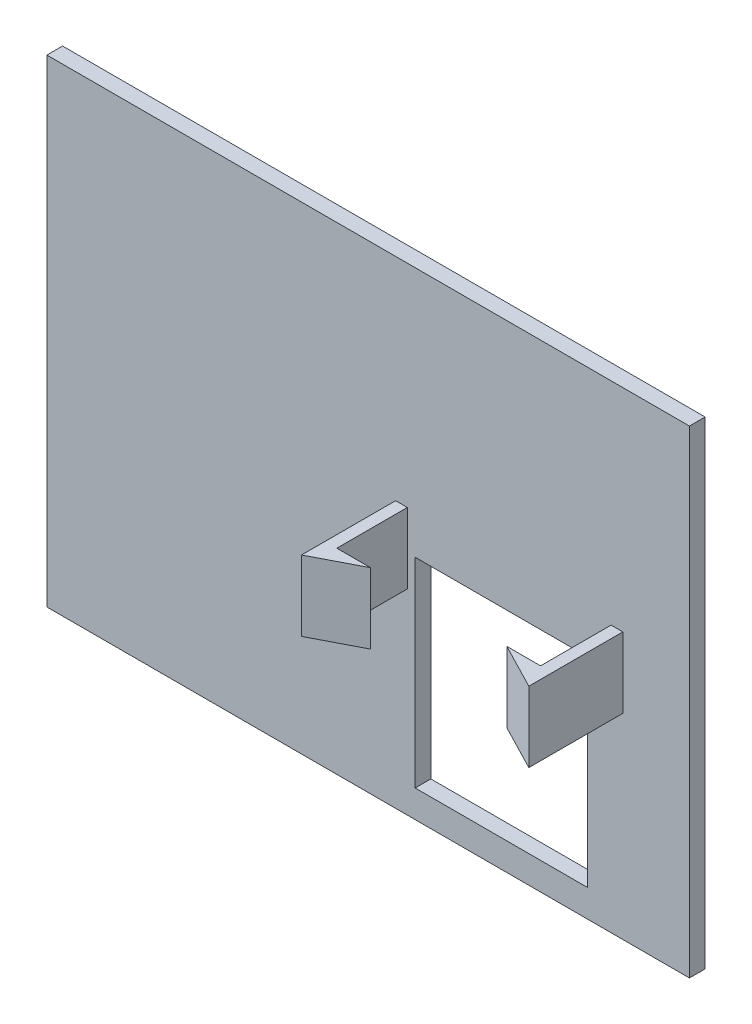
from build123d import *

# Parameters (mm, degrees)
CROQUIS1_W              = 82
CROQUIS1_H              = 61
SALIENTE_EXTRUIR1_DEPTH = 2
CROQUIS2_W              = 22
CROQUIS2_H              = 25.5
CORTAR_EXTRUIR1_DEPTH   = 2
CROQUIS8_W              = 1.5
CROQUIS8_H              = 9
SALIENTE_EXTRUIR2_DEPTH = 14
CROQUIS9_W              = 4.3
CROQUIS9_H              = 9
SALIENTE_EXTRUIR3_DEPTH = 3
CORTAR_EXTRUIR2_DEPTH   = 10
CROQUIS11_W             = 6.564102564
CROQUIS11_H             = 1.148717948
CROQUIS11_W_2           = 6.4
CROQUIS11_W_3           = 2.923076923
CROQUIS11_H_2           = 0.358974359
SALIENTE_EXTRUIR4_DEPTH = 1


with BuildPart() as part:
    # Croquis1 → Saliente-Extruir1 (new body)
    with BuildSketch(Plane.XY):
        with Locations((-6.383707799, 7.967462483)):
            Rectangle(CROQUIS1_W, CROQUIS1_H)
    extrude(amount=SALIENTE_EXTRUIR1_DEPTH)

    # Croquis2 → Cortar-Extruir1 (cut)
    with BuildSketch(Plane(origin=(0, 0, 0), x_dir=(-1, 0, 0), z_dir=(0, 0, -1))):
        with Locations((-10.616292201, -6.282537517)):
            Rectangle(CROQUIS2_W, CROQUIS2_H)
    extrude(amount=-CORTAR_EXTRUIR1_DEPTH, mode=Mode.SUBTRACT)

    # Croquis8 → Saliente-Extruir2 (add)
    with BuildSketch(Plane(origin=(0, 0, 0), x_dir=(-1, 0, 0), z_dir=(0, 0, -1))):
        with Locations((-25.366292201, 6.967462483)):
            Rectangle(CROQUIS8_W, CROQUIS8_H)
        with Locations((2.133707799, 6.967462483)):
            Rectangle(CROQUIS8_W, CROQUIS8_H)
    extrude(amount=-SALIENTE_EXTRUIR2_DEPTH)

    # Croquis9 → Saliente-Extruir3 (add)
    with BuildSketch(Plane.XY.offset(14)):
        with Locations((0.766292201, 6.967462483)):
            Rectangle(CROQUIS9_W, CROQUIS9_H)
        with Locations((22.466292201, 6.967462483)):
            Rectangle(CROQUIS9_W, CROQUIS9_H)
    extrude(amount=-SALIENTE_EXTRUIR3_DEPTH)

    # Croquis10 → Cortar-Extruir2 (cut)
    with BuildSketch(Plane.XZ.offset(-2.467462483)):
        Polygon((-2.883707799, 14), (2.916292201, 11), (2.916292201, 14), align=None)
        Polygon((20.316292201, 11), (26.116292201, 14), (20.316292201, 14), align=None)
    extrude(amount=-CORTAR_EXTRUIR2_DEPTH, mode=Mode.SUBTRACT)

    # Croquis11 → Saliente-Extruir4 (add)
    # profile 1 of 29: a face of its own
    with BuildSketch(Plane(origin=(0, 0, 0), x_dir=(-1, 0, 0), z_dir=(0, 0, -1))):
        Polygon((19.022350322, -20.287665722), (19.022350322, -19.09535803), (23.486452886, -17.63510162), (19.022350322, -16.164588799), (19.022350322, -14.983819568), (25.422350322, -13.901768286), (25.422350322, -15.064588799), (21.38004263, -15.747922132), (25.422350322, -17.078691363), (25.422350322, -18.199204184), (21.38004263, -19.522281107), (25.422350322, -20.204332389), (25.422350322, -21.368434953), align=None)
    # profile 2 of 29: a face of its own
    with BuildSketch(Plane(origin=(0, 0, 0), x_dir=(-1, 0, 0), z_dir=(0, 0, -1))):
        with BuildLine():
            add(Edge.make_bspline(
                [(20.663375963, -10.770999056), (20.664329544, -10.716686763), (20.666218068, -10.609123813), (20.682339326, -10.448977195), (20.707636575, -10.291318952), (20.743944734, -10.136494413), (20.788487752, -9.983621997), (20.845718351, -9.834326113), (20.910462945, -9.685858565), (20.987825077, -9.54235819), (21.07162212, -9.402654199), (21.164216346, -9.270339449), (21.264400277, -9.145676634), (21.371851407, -9.029078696), (21.486655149, -8.921222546), (21.607579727, -8.820090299), (21.737204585, -8.728515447), (21.872727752, -8.643854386), (22.013203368, -8.568448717), (22.157697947, -8.50298128), (22.304202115, -8.446159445), (22.454503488, -8.401669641), (22.606619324, -8.364836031), (22.762413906, -8.341591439), (22.920286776, -8.325066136), (23.026579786, -8.323213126), (23.08004263, -8.322281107)],
                knots=[0, 0, 0, 0, 1.022405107, 2.024825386, 3.027536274, 4.026883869, 5.01725043, 6.023055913, 7.035310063, 8.064783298, 9.090097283, 10.101295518, 11.102843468, 12.099336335, 13.084064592, 14.066917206, 15.06496821, 16.069711, 17.07409931, 18.064335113, 19.055093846, 20.030042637, 21.013718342, 21.999268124, 22.993679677, 24, 24, 24, 24], degree=3))
            add(Edge.make_bspline(
                [(23.08004263, -8.322281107), (23.133922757, -8.323265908), (23.241048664, -8.325223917), (23.400412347, -8.340979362), (23.556917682, -8.367140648), (23.711217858, -8.400593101), (23.861653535, -8.448448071), (24.010758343, -8.502110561), (24.15573693, -8.570469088), (24.298854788, -8.645051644), (24.436648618, -8.72900628), (24.566818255, -8.822183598), (24.689602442, -8.922043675), (24.805666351, -9.028246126), (24.912357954, -9.143087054), (25.011185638, -9.265548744), (25.103482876, -9.394412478), (25.187050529, -9.530647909), (25.260480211, -9.67249846), (25.326682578, -9.817574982), (25.381800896, -9.966724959), (25.426748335, -10.119639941), (25.46155002, -10.276412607), (25.485191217, -10.436696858), (25.501633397, -10.600147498), (25.503472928, -10.710274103), (25.504401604, -10.76587085)],
                knots=[0, 0, 0, 0, 1.012065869, 2.012216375, 3.004733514, 3.992205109, 4.97496602, 5.968164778, 6.966799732, 7.983091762, 8.999225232, 9.995016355, 10.988052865, 11.970944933, 12.947950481, 13.92969433, 14.925485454, 15.92373309, 16.929186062, 17.924491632, 18.917690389, 19.913513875, 20.91665649, 21.931711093, 22.955836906, 24, 24, 24, 24], degree=3))
            add(Edge.make_bspline(
                [(25.504401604, -10.76587085), (25.502012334, -10.847163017), (25.497303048, -11.007391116), (25.46513307, -11.243397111), (25.409516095, -11.47001297), (25.332771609, -11.688293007), (25.231409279, -11.896224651), (25.111183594, -12.096623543), (24.965419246, -12.285444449), (24.802236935, -12.464568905), (24.622607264, -12.627435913), (24.432084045, -12.771152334), (24.231272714, -12.891951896), (24.020979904, -12.991638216), (23.800849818, -13.068494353), (23.571636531, -13.124018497), (23.332669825, -13.156271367), (23.170309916, -13.160934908), (23.087734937, -13.163306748)],
                knots=[0, 0, 0, 0, 1.030098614, 2.030340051, 3.011502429, 3.982690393, 4.9563966, 5.938096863, 6.938909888, 7.973851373, 9.005145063, 10.007012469, 10.993347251, 11.969610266, 12.95101174, 13.942698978, 14.953672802, 16, 16, 16, 16], degree=3))
            add(Edge.make_bspline(
                [(23.087734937, -13.163306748), (22.999562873, -13.160852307), (22.826262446, -13.156028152), (22.572373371, -13.117722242), (22.329286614, -13.056551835), (22.097682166, -12.968745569), (21.877132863, -12.856580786), (21.668103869, -12.719653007), (21.470547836, -12.557285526), (21.351059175, -12.432944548), (21.29029904, -12.369717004)],
                knots=[0, 0, 0, 0, 1.043912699, 2.05178951, 3.033892, 4.007821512, 4.978932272, 5.95884105, 6.962068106, 8, 8, 8, 8], degree=3))
            add(Edge.make_bspline(
                [(21.29029904, -12.369717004), (21.239935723, -12.311699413), (21.140579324, -12.197242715), (21.01456202, -12.011288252), (20.905721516, -11.820891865), (20.816234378, -11.623771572), (20.748762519, -11.419377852), (20.699649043, -11.208758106), (20.669482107, -10.991956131), (20.665421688, -10.845025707), (20.663375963, -10.770999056)],
                knots=[0, 0, 0, 0, 1.048115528, 2.067714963, 3.060638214, 4.039924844, 5.017819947, 5.994373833, 6.98952318, 8, 8, 8, 8], degree=3))
        make_face()
        with BuildLine():
            add(Edge.make_bspline(
                [(21.73004263, -10.74535803), (21.73146732, -10.789848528), (21.734271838, -10.877428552), (21.750639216, -11.005984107), (21.779859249, -11.128715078), (21.823651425, -11.24474799), (21.87517262, -11.357023), (21.941379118, -11.462375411), (22.019134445, -11.561598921), (22.106879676, -11.655082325), (22.204983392, -11.738594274), (22.309972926, -11.812655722), (22.421228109, -11.875961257), (22.540472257, -11.9254606), (22.665088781, -11.9658988), (22.797069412, -11.993364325), (22.935040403, -12.012450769), (23.029547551, -12.013869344), (23.077478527, -12.014588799)],
                knots=[0, 0, 0, 0, 1.030405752, 2.028364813, 2.995676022, 3.944329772, 4.896127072, 5.85177522, 6.817820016, 7.811895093, 8.815529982, 9.795715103, 10.783861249, 11.772750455, 12.780524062, 13.813161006, 14.890905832, 16, 16, 16, 16], degree=3))
            add(Edge.make_bspline(
                [(23.077478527, -12.014588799), (23.12710036, -12.013748), (23.224076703, -12.01210482), (23.365671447, -11.99507518), (23.500058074, -11.967023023), (23.626963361, -11.927065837), (23.747187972, -11.877318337), (23.859585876, -11.81502975), (23.964723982, -11.741882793), (24.062190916, -11.658517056), (24.15019551, -11.566616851), (24.228026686, -11.467927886), (24.291572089, -11.361608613), (24.346797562, -11.251259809), (24.387096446, -11.133796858), (24.417348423, -11.011194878), (24.433508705, -10.882110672), (24.436306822, -10.794115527), (24.437734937, -10.749204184)],
                knots=[0, 0, 0, 0, 1.141979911, 2.23178043, 3.277659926, 4.298338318, 5.290546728, 6.26815979, 7.25071132, 8.234641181, 9.215812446, 10.176243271, 11.121178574, 12.06282999, 13.01190517, 13.973595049, 14.965754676, 16, 16, 16, 16], degree=3))
            add(Edge.make_bspline(
                [(24.437734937, -10.749204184), (24.436471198, -10.704268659), (24.433993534, -10.616168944), (24.415439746, -10.486957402), (24.386239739, -10.363640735), (24.345030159, -10.245676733), (24.290978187, -10.134019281), (24.224773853, -10.028240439), (24.147885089, -9.927411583), (24.057852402, -9.834850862), (23.960189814, -9.74919105), (23.854303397, -9.673992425), (23.741315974, -9.611639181), (23.62186131, -9.559178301), (23.495261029, -9.520087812), (23.361757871, -9.492137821), (23.222042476, -9.473105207), (23.126261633, -9.471709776), (23.077478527, -9.470999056)],
                knots=[0, 0, 0, 0, 1.03148129, 2.022302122, 2.990961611, 3.937500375, 4.885462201, 5.833017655, 6.798640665, 7.791063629, 8.792613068, 9.77817235, 10.766512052, 11.750898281, 12.768848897, 13.802335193, 14.880685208, 16, 16, 16, 16], degree=3))
            add(Edge.make_bspline(
                [(23.077478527, -9.470999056), (23.02871073, -9.47185097), (22.933012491, -9.473522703), (22.793132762, -9.490547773), (22.660371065, -9.518345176), (22.535294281, -9.558742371), (22.416475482, -9.608603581), (22.304522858, -9.670185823), (22.199987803, -9.744118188), (22.103388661, -9.827933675), (22.016261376, -9.920633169), (21.938564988, -10.018968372), (21.874304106, -10.125187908), (21.8213302, -10.237299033), (21.780574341, -10.355600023), (21.75032153, -10.479958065), (21.734345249, -10.610754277), (21.731491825, -10.700021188), (21.73004263, -10.74535803)],
                knots=[0, 0, 0, 0, 1.123894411, 2.205445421, 3.243160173, 4.246488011, 5.231014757, 6.210004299, 7.185865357, 8.177612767, 9.153374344, 10.115157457, 11.061423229, 12.009021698, 12.96873347, 13.94135618, 14.954456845, 16, 16, 16, 16], degree=3))
        make_face(mode=Mode.SUBTRACT)
    # profile 3 of 29: a face of its own
    with BuildSketch(Plane(origin=(0, 0, 0), x_dir=(-1, 0, 0), z_dir=(0, 0, -1))):
        with BuildLine():
            Line((18.858247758, -3.809460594), (18.858247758, -2.660742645))
            Line((18.858247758, -2.660742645), (25.422350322, -2.660742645))
            Line((25.422350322, -2.660742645), (25.422350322, -3.809460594))
            Line((25.422350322, -3.809460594), (24.912093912, -3.809460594))
            add(Edge.make_bspline(
                [(24.912093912, -3.809460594), (24.96161992, -3.866476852), (25.05790423, -3.977323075), (25.184915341, -4.150096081), (25.286103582, -4.32591241), (25.368673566, -4.501334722), (25.429221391, -4.681380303), (25.47318509, -4.866675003), (25.499082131, -5.060011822), (25.502609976, -5.191434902), (25.504401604, -5.258178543)],
                knots=[0, 0, 0, 0, 1.129123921, 2.195147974, 3.200207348, 4.157999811, 5.089597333, 6.035096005, 7.002117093, 8, 8, 8, 8], degree=3))
            add(Edge.make_bspline(
                [(25.504401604, -5.258178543), (25.502716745, -5.333102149), (25.499387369, -5.481155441), (25.464316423, -5.698399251), (25.41068379, -5.908200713), (25.33459994, -6.110241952), (25.236595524, -6.304916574), (25.116301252, -6.491131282), (24.975892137, -6.670838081), (24.813925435, -6.838940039), (24.637925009, -6.994894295), (24.448102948, -7.130068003), (24.248258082, -7.245292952), (24.037464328, -7.338605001), (23.816471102, -7.412419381), (23.584653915, -7.464964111), (23.342001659, -7.495983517), (23.176713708, -7.499821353), (23.092863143, -7.501768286)],
                knots=[0, 0, 0, 0, 0.980565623, 1.937653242, 2.874408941, 3.813202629, 4.759425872, 5.723639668, 6.712366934, 7.741707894, 8.776921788, 9.78808311, 10.788528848, 11.79333378, 12.802261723, 13.835597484, 14.901998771, 16, 16, 16, 16], degree=3))
            add(Edge.make_bspline(
                [(23.092863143, -7.501768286), (23.006035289, -7.4997262), (22.83571278, -7.495720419), (22.58578493, -7.46637149), (22.348195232, -7.414860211), (22.122455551, -7.344087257), (21.908497, -7.254621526), (21.707180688, -7.143356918), (21.517784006, -7.011858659), (21.342398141, -6.861670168), (21.18393568, -6.696840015), (21.045219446, -6.521915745), (20.92513481, -6.339405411), (20.830878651, -6.145721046), (20.755884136, -5.944818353), (20.701576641, -5.735306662), (20.668856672, -5.516910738), (20.665218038, -5.368119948), (20.663375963, -5.292793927)],
                knots=[0, 0, 0, 0, 1.136200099, 2.228783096, 3.287341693, 4.313263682, 5.320819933, 6.317074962, 7.317731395, 8.33320375, 9.333922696, 10.3051871, 11.251461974, 12.186899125, 13.117710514, 14.053682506, 15.014667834, 16, 16, 16, 16], degree=3))
            add(Edge.make_bspline(
                [(20.663375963, -5.292793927), (20.665403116, -5.223033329), (20.669413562, -5.085021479), (20.699640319, -4.881822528), (20.748827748, -4.685268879), (20.816313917, -4.494866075), (20.906022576, -4.311953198), (21.014068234, -4.13591169), (21.141509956, -3.96620579), (21.240075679, -3.862369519), (21.29029904, -3.809460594)],
                knots=[0, 0, 0, 0, 1.011981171, 2.002067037, 2.973628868, 3.94845042, 4.927444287, 5.923956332, 6.942168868, 8, 8, 8, 8], degree=3))
            Line((21.29029904, -3.809460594), (18.858247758, -3.809460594))
        make_face()
        with BuildLine():
            add(Edge.make_bspline(
                [(21.73004263, -5.051768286), (21.731447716, -5.097540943), (21.734201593, -5.187252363), (21.750750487, -5.319191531), (21.779957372, -5.445261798), (21.822942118, -5.564676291), (21.875774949, -5.678602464), (21.939792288, -5.787064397), (22.017820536, -5.888505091), (22.105568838, -5.983936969), (22.202139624, -6.071526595), (22.308355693, -6.145176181), (22.419111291, -6.210568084), (22.537304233, -6.263315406), (22.662792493, -6.302363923), (22.794182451, -6.332833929), (22.932647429, -6.348721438), (23.027017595, -6.351592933), (23.074914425, -6.353050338)],
                knots=[0, 0, 0, 0, 1.048146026, 2.054297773, 3.039291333, 4.004895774, 4.954855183, 5.911393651, 6.882091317, 7.879305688, 8.877191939, 9.859995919, 10.833402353, 11.818978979, 12.815424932, 13.838562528, 14.902979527, 16, 16, 16, 16], degree=3))
            add(Edge.make_bspline(
                [(23.074914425, -6.353050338), (23.123245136, -6.351613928), (23.218480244, -6.348783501), (23.358121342, -6.332592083), (23.491401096, -6.303155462), (23.617138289, -6.260064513), (23.737067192, -6.208088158), (23.849930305, -6.142866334), (23.956225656, -6.066181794), (24.054548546, -5.977604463), (24.143674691, -5.880883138), (24.2222102, -5.777888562), (24.290015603, -5.66984547), (24.34306136, -5.555257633), (24.386673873, -5.436344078), (24.415451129, -5.310983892), (24.433876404, -5.180519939), (24.436439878, -5.091574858), (24.437734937, -5.046640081)],
                knots=[0, 0, 0, 0, 1.099325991, 2.166209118, 3.191924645, 4.196940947, 5.184751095, 6.160002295, 7.155385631, 8.160260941, 9.164478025, 10.142244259, 11.102414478, 12.058888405, 13.008821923, 13.977708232, 14.978344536, 16, 16, 16, 16], degree=3))
            add(Edge.make_bspline(
                [(24.437734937, -5.046640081), (24.436323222, -5.000014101), (24.433555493, -4.908601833), (24.417140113, -4.774520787), (24.387890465, -4.646718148), (24.344425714, -4.525840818), (24.292646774, -4.409418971), (24.22639823, -4.300300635), (24.149242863, -4.197080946), (24.060475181, -4.101678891), (23.96442546, -4.012820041), (23.85770096, -3.937258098), (23.745087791, -3.870931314), (23.623730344, -3.818855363), (23.495872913, -3.777475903), (23.360688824, -3.747793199), (23.218041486, -3.731646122), (23.120678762, -3.728839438), (23.071068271, -3.727409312)],
                knots=[0, 0, 0, 0, 1.050155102, 2.058874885, 3.037059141, 3.995876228, 4.947712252, 5.901735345, 6.864168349, 7.84500044, 8.832936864, 9.80518476, 10.78407896, 11.771077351, 12.772424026, 13.806938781, 14.882541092, 16, 16, 16, 16], degree=3))
            add(Edge.make_bspline(
                [(23.071068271, -3.727409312), (23.022310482, -3.728820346), (22.927072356, -3.731576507), (22.787411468, -3.7478774), (22.654852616, -3.777703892), (22.52896096, -3.818593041), (22.409779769, -3.870940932), (22.299595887, -3.937646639), (22.194283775, -4.012789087), (22.099722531, -4.101816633), (22.011521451, -4.196806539), (21.937923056, -4.301864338), (21.872863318, -4.411040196), (21.81975253, -4.526905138), (21.780718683, -4.649876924), (21.750525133, -4.777883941), (21.73420928, -4.912890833), (21.731454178, -5.004720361), (21.73004263, -5.051768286)],
                knots=[0, 0, 0, 0, 1.106392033, 2.161105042, 3.184375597, 4.183944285, 5.160535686, 6.12997743, 7.101598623, 8.089721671, 9.071306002, 10.0372504, 10.99341283, 11.95232427, 12.921232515, 13.916134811, 14.932352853, 16, 16, 16, 16], degree=3))
        make_face(mode=Mode.SUBTRACT)
    # profile 4 of 29: a face of its own
    with BuildSketch(Plane(origin=(0, 0, 0), x_dir=(-1, 0, 0), z_dir=(0, 0, -1))):
        with BuildLine():
            Line((20.745427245, -1.512024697), (20.745427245, -0.363306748))
            Line((20.745427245, -0.363306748), (22.99029904, -0.363306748))
            add(Edge.make_bspline(
                [(22.99029904, -0.363306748), (23.042868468, -0.363204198), (23.143762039, -0.363007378), (23.28866576, -0.357566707), (23.421170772, -0.349898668), (23.541023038, -0.340469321), (23.648322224, -0.326074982), (23.74326772, -0.309462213), (23.826408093, -0.291511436), (23.918632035, -0.260359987), (24.019628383, -0.212972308), (24.128012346, -0.142585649), (24.219849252, -0.05456396), (24.298816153, 0.045932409), (24.362942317, 0.160939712), (24.404841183, 0.29042181), (24.433385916, 0.431179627), (24.436247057, 0.529272), (24.437734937, 0.580282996)],
                knots=[0, 0, 0, 0, 1.26765481, 2.432939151, 3.496235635, 4.468482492, 5.331342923, 6.105650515, 6.79313286, 7.379749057, 8.449369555, 9.475508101, 10.481577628, 11.502059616, 12.549100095, 13.637618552, 14.771490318, 16, 16, 16, 16], degree=3))
            add(Edge.make_bspline(
                [(24.437734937, 0.580282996), (24.436038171, 0.631250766), (24.432764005, 0.729600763), (24.406883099, 0.87126762), (24.363335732, 1.001145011), (24.301472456, 1.118186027), (24.223406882, 1.223184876), (24.12775453, 1.312951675), (24.015719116, 1.389093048), (23.932017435, 1.425620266), (23.889016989, 1.44438556)],
                knots=[0, 0, 0, 0, 1.117055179, 2.15552637, 3.145290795, 4.109392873, 5.046474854, 6.001011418, 6.973050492, 8, 8, 8, 8], degree=3))
            add(Edge.make_bspline(
                [(23.889016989, 1.44438556), (23.869920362, 1.451274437), (23.827766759, 1.466480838), (23.755045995, 1.480014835), (23.669283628, 1.494581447), (23.568731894, 1.506104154), (23.454013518, 1.512624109), (23.324983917, 1.519609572), (23.181771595, 1.52316949), (23.081326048, 1.523631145), (23.028760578, 1.523872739)],
                knots=[0, 0, 0, 0, 0.56094539, 1.238222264, 2.041156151, 2.969685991, 4.036367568, 5.220421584, 6.545382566, 8, 8, 8, 8], degree=3))
            Line((23.028760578, 1.523872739), (20.745427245, 1.523872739))
            Line((20.745427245, 1.523872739), (20.745427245, 2.672590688))
            Line((20.745427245, 2.672590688), (22.71081186, 2.672590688))
            add(Edge.make_bspline(
                [(22.71081186, 2.672590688), (22.808259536, 2.67238938), (22.995096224, 2.672003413), (23.263111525, 2.661105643), (23.5072012, 2.645891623), (23.727250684, 2.62678555), (23.923641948, 2.598442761), (24.09564099, 2.564239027), (24.245148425, 2.52621321), (24.333734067, 2.491357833), (24.374914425, 2.475154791)],
                knots=[0, 0, 0, 0, 1.388064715, 2.661340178, 3.820320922, 4.871937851, 5.806920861, 6.64504548, 7.370129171, 8, 8, 8, 8], degree=3))
            add(Edge.make_bspline(
                [(24.374914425, 2.475154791), (24.419237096, 2.454385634), (24.506726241, 2.413389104), (24.631116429, 2.342252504), (24.748966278, 2.265563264), (24.857501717, 2.179672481), (24.957825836, 2.086333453), (25.052219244, 1.98818458), (25.136838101, 1.880805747), (25.213859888, 1.766981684), (25.282231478, 1.645124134), (25.342820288, 1.516067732), (25.39212919, 1.378417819), (25.43392544, 1.233367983), (25.465095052, 1.080249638), (25.488703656, 0.919371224), (25.500904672, 0.750556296), (25.503216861, 0.635427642), (25.504401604, 0.576436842)],
                knots=[0, 0, 0, 0, 0.997311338, 1.968606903, 2.91805772, 3.860812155, 4.785445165, 5.709667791, 6.633356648, 7.568312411, 8.508286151, 9.478643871, 10.470653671, 11.485274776, 12.552984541, 13.653035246, 14.797438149, 16, 16, 16, 16], degree=3))
            add(Edge.make_bspline(
                [(25.504401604, 0.576436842), (25.503626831, 0.512714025), (25.502110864, 0.388030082), (25.484127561, 0.205804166), (25.459833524, 0.032477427), (25.422476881, -0.131335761), (25.373526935, -0.28550222), (25.314946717, -0.43071225), (25.245184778, -0.566150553), (25.165653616, -0.692520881), (25.075325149, -0.808722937), (24.978286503, -0.917512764), (24.870484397, -1.01459257), (24.756337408, -1.105733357), (24.631868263, -1.185360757), (24.500287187, -1.258021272), (24.360131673, -1.321281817), (24.261960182, -1.355102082), (24.212093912, -1.372281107)],
                knots=[0, 0, 0, 0, 1.21116517, 2.369839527, 3.478781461, 4.537307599, 5.560113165, 6.551481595, 7.51089908, 8.453199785, 9.386099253, 10.306565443, 11.221022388, 12.141093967, 13.080939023, 14.026457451, 14.997537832, 16, 16, 16, 16], degree=3))
            add(Edge.make_bspline(
                [(24.212093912, -1.372281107), (24.17336213, -1.383996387), (24.089924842, -1.409233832), (23.951261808, -1.43648254), (23.791444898, -1.458277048), (23.610316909, -1.479478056), (23.407574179, -1.494268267), (23.183538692, -1.503935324), (22.937772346, -1.510467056), (22.76679929, -1.511490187), (22.677478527, -1.512024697)],
                knots=[0, 0, 0, 0, 0.627914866, 1.352675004, 2.190563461, 3.132055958, 4.183353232, 5.345633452, 6.613289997, 8, 8, 8, 8], degree=3))
            Line((22.677478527, -1.512024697), (20.745427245, -1.512024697))
        make_face()
    # profile 5 of 29: a face of its own
    with BuildSketch(Plane(origin=(0, 0, 0), x_dir=(-1, 0, 0), z_dir=(0, 0, -1))):
        with Locations((22.14029904, 4.313616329)):
            Rectangle(CROQUIS11_W, CROQUIS11_H)
    # profile 6 of 29: a face of its own
    with BuildSketch(Plane(origin=(0, 0, 0), x_dir=(-1, 0, 0), z_dir=(0, 0, -1))):
        with BuildLine():
            add(Edge.make_bspline(
                [(20.663375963, 8.182847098), (20.664329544, 8.237159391), (20.666218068, 8.344722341), (20.682339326, 8.504868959), (20.707636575, 8.662527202), (20.743944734, 8.817351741), (20.788487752, 8.970224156), (20.845718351, 9.119520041), (20.910462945, 9.267987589), (20.987825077, 9.411487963), (21.07162212, 9.551191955), (21.164216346, 9.683506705), (21.264400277, 9.80816952), (21.371851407, 9.924767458), (21.486655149, 10.032623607), (21.607579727, 10.133755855), (21.737204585, 10.225330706), (21.872727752, 10.309991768), (22.013203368, 10.385397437), (22.157697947, 10.450864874), (22.304202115, 10.507686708), (22.454503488, 10.552176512), (22.606619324, 10.589010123), (22.762413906, 10.612254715), (22.920286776, 10.628780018), (23.026579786, 10.630633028), (23.08004263, 10.631565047)],
                knots=[0, 0, 0, 0, 1.022405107, 2.024825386, 3.027536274, 4.026883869, 5.01725043, 6.023055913, 7.035310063, 8.064783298, 9.090097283, 10.101295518, 11.102843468, 12.099336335, 13.084064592, 14.066917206, 15.06496821, 16.069711, 17.07409931, 18.064335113, 19.055093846, 20.030042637, 21.013718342, 21.999268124, 22.993679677, 24, 24, 24, 24], degree=3))
            add(Edge.make_bspline(
                [(23.08004263, 10.631565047), (23.133922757, 10.630580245), (23.241048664, 10.628622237), (23.400412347, 10.612866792), (23.556917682, 10.586705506), (23.711217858, 10.553253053), (23.861653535, 10.505398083), (24.010758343, 10.451735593), (24.15573693, 10.383377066), (24.298854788, 10.30879451), (24.436648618, 10.224839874), (24.566818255, 10.131662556), (24.689602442, 10.031802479), (24.805666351, 9.925600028), (24.912357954, 9.8107591), (25.011185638, 9.68829741), (25.103482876, 9.559433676), (25.187050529, 9.423198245), (25.260480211, 9.281347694), (25.326682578, 9.136271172), (25.381800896, 8.987121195), (25.426748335, 8.834206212), (25.46155002, 8.677433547), (25.485191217, 8.517149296), (25.501633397, 8.353698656), (25.503472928, 8.243572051), (25.504401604, 8.187975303)],
                knots=[0, 0, 0, 0, 1.012065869, 2.012216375, 3.004733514, 3.992205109, 4.97496602, 5.968164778, 6.966799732, 7.983091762, 8.999225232, 9.995016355, 10.988052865, 11.970944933, 12.947950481, 13.92969433, 14.925485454, 15.92373309, 16.929186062, 17.924491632, 18.917690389, 19.913513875, 20.91665649, 21.931711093, 22.955836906, 24, 24, 24, 24], degree=3))
            add(Edge.make_bspline(
                [(25.504401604, 8.187975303), (25.502012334, 8.106683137), (25.497303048, 7.946455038), (25.46513307, 7.710449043), (25.409516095, 7.483833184), (25.332771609, 7.265553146), (25.231409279, 7.057621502), (25.111183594, 6.85722261), (24.965419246, 6.668401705), (24.802236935, 6.489277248), (24.622607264, 6.326410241), (24.432084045, 6.18269382), (24.231272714, 6.061894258), (24.020979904, 5.962207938), (23.800849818, 5.885351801), (23.571636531, 5.829827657), (23.332669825, 5.797574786), (23.170309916, 5.792911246), (23.087734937, 5.790539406)],
                knots=[0, 0, 0, 0, 1.030098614, 2.030340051, 3.011502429, 3.982690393, 4.9563966, 5.938096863, 6.938909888, 7.973851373, 9.005145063, 10.007012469, 10.993347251, 11.969610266, 12.95101174, 13.942698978, 14.953672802, 16, 16, 16, 16], degree=3))
            add(Edge.make_bspline(
                [(23.087734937, 5.790539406), (22.999562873, 5.792993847), (22.826262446, 5.797818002), (22.572373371, 5.836123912), (22.329286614, 5.897294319), (22.097682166, 5.985100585), (21.877132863, 6.097265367), (21.668103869, 6.234193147), (21.470547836, 6.396560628), (21.351059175, 6.520901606), (21.29029904, 6.58412915)],
                knots=[0, 0, 0, 0, 1.043912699, 2.05178951, 3.033892, 4.007821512, 4.978932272, 5.95884105, 6.962068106, 8, 8, 8, 8], degree=3))
            add(Edge.make_bspline(
                [(21.29029904, 6.58412915), (21.239935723, 6.642146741), (21.140579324, 6.756603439), (21.01456202, 6.942557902), (20.905721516, 7.132954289), (20.816234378, 7.330074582), (20.748762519, 7.534468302), (20.699649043, 7.745088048), (20.669482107, 7.961890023), (20.665421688, 8.108820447), (20.663375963, 8.182847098)],
                knots=[0, 0, 0, 0, 1.048115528, 2.067714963, 3.060638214, 4.039924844, 5.017819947, 5.994373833, 6.98952318, 8, 8, 8, 8], degree=3))
        make_face()
        with BuildLine():
            add(Edge.make_bspline(
                [(21.73004263, 8.208488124), (21.73146732, 8.163997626), (21.734271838, 8.076417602), (21.750639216, 7.947862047), (21.779859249, 7.825131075), (21.823651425, 7.709098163), (21.87517262, 7.596823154), (21.941379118, 7.491470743), (22.019134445, 7.392247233), (22.106879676, 7.298763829), (22.204983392, 7.21525188), (22.309972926, 7.141190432), (22.421228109, 7.077884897), (22.540472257, 7.028385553), (22.665088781, 6.987947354), (22.797069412, 6.960481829), (22.935040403, 6.941395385), (23.029547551, 6.93997681), (23.077478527, 6.939257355)],
                knots=[0, 0, 0, 0, 1.030405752, 2.028364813, 2.995676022, 3.944329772, 4.896127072, 5.85177522, 6.817820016, 7.811895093, 8.815529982, 9.795715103, 10.783861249, 11.772750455, 12.780524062, 13.813161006, 14.890905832, 16, 16, 16, 16], degree=3))
            add(Edge.make_bspline(
                [(23.077478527, 6.939257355), (23.12710036, 6.940098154), (23.224076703, 6.941741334), (23.365671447, 6.958770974), (23.500058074, 6.98682313), (23.626963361, 7.026780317), (23.747187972, 7.076527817), (23.859585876, 7.138816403), (23.964723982, 7.211963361), (24.062190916, 7.295329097), (24.15019551, 7.387229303), (24.228026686, 7.485918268), (24.291572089, 7.592237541), (24.346797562, 7.702586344), (24.387096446, 7.820049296), (24.417348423, 7.942651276), (24.433508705, 8.071735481), (24.436306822, 8.159730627), (24.437734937, 8.20464197)],
                knots=[0, 0, 0, 0, 1.141979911, 2.23178043, 3.277659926, 4.298338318, 5.290546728, 6.26815979, 7.25071132, 8.234641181, 9.215812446, 10.176243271, 11.121178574, 12.06282999, 13.01190517, 13.973595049, 14.965754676, 16, 16, 16, 16], degree=3))
            add(Edge.make_bspline(
                [(24.437734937, 8.20464197), (24.436471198, 8.249577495), (24.433993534, 8.337677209), (24.415439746, 8.466888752), (24.386239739, 8.590205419), (24.345030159, 8.708169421), (24.290978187, 8.819826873), (24.224773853, 8.925605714), (24.147885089, 9.026434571), (24.057852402, 9.118995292), (23.960189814, 9.204655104), (23.854303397, 9.279853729), (23.741315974, 9.342206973), (23.62186131, 9.394667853), (23.495261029, 9.433758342), (23.361757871, 9.461708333), (23.222042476, 9.480740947), (23.126261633, 9.482136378), (23.077478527, 9.482847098)],
                knots=[0, 0, 0, 0, 1.03148129, 2.022302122, 2.990961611, 3.937500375, 4.885462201, 5.833017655, 6.798640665, 7.791063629, 8.792613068, 9.77817235, 10.766512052, 11.750898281, 12.768848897, 13.802335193, 14.880685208, 16, 16, 16, 16], degree=3))
            add(Edge.make_bspline(
                [(23.077478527, 9.482847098), (23.02871073, 9.481995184), (22.933012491, 9.480323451), (22.793132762, 9.463298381), (22.660371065, 9.435500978), (22.535294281, 9.395103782), (22.416475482, 9.345242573), (22.304522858, 9.283660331), (22.199987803, 9.209727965), (22.103388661, 9.125912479), (22.016261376, 9.033212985), (21.938564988, 8.934877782), (21.874304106, 8.828658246), (21.8213302, 8.716547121), (21.780574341, 8.598246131), (21.75032153, 8.473888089), (21.734345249, 8.343091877), (21.731491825, 8.253824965), (21.73004263, 8.208488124)],
                knots=[0, 0, 0, 0, 1.123894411, 2.205445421, 3.243160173, 4.246488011, 5.231014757, 6.210004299, 7.185865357, 8.177612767, 9.153374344, 10.115157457, 11.061423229, 12.009021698, 12.96873347, 13.94135618, 14.954456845, 16, 16, 16, 16], degree=3))
        make_face(mode=Mode.SUBTRACT)
    # profile 7 of 29: a face of its own
    with BuildSketch(Plane(origin=(0, 0, 0), x_dir=(-1, 0, 0), z_dir=(0, 0, -1))):
        Polygon((19.022350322, 16.703359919), (19.022350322, 17.737975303), (23.233888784, 20.641821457), (19.022350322, 20.641821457), (19.022350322, 21.790539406), (25.422350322, 21.790539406), (25.422350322, 20.748231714), (21.223632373, 17.852077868), (25.422350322, 17.852077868), (25.422350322, 16.703359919), align=None)
    # profile 8 of 29: a face of its own
    with BuildSketch(Plane(origin=(0, 0, 0), x_dir=(-1, 0, 0), z_dir=(0, 0, -1))):
        with BuildLine():
            Line((19.022350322, 23.267462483), (19.022350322, 24.71489838))
            add(Edge.make_bspline(
                [(19.022350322, 24.71489838), (19.023120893, 24.827745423), (19.024610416, 25.045880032), (19.042036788, 25.361868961), (19.06762384, 25.655919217), (19.106793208, 25.927361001), (19.152226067, 26.177187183), (19.21317129, 26.40350274), (19.282664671, 26.607948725), (19.364650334, 26.792510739), (19.460186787, 26.961005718), (19.566619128, 27.120995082), (19.687831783, 27.272167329), (19.821490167, 27.416643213), (19.970038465, 27.552558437), (20.131016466, 27.682176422), (20.306758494, 27.802323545), (20.493050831, 27.916631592), (20.690682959, 28.020008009), (20.897972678, 28.110176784), (21.113586, 28.185711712), (21.337752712, 28.247087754), (21.56972865, 28.296011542), (21.809981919, 28.330242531), (22.058290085, 28.351404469), (22.226580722, 28.353551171), (22.312093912, 28.35464197)],
                knots=[0, 0, 0, 0, 1.443572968, 2.79044287, 4.047742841, 5.218390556, 6.298195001, 7.294187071, 8.214052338, 9.058415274, 9.873579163, 10.689402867, 11.514245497, 12.34988967, 13.204999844, 14.087904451, 14.991805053, 15.926675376, 16.882870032, 17.842731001, 18.816259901, 19.80313118, 20.814314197, 21.847329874, 22.906167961, 24, 24, 24, 24], degree=3))
            add(Edge.make_bspline(
                [(22.312093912, 28.35464197), (22.432758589, 28.351785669), (22.67029407, 28.346162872), (23.018874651, 28.298799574), (23.353023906, 28.222197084), (23.670127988, 28.114487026), (23.967363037, 27.980955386), (24.23948745, 27.821436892), (24.485040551, 27.638270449), (24.702799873, 27.433589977), (24.889966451, 27.211970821), (25.05026273, 26.981664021), (25.176663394, 26.740425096), (25.256839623, 26.527861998), (25.306656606, 26.34353819), (25.336254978, 26.181720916), (25.362666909, 25.997788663), (25.386257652, 25.790521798), (25.401980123, 25.55994072), (25.412989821, 25.306006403), (25.421128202, 25.029052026), (25.421932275, 24.8366997), (25.422350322, 24.736693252)],
                knots=[0, 0, 0, 0, 1.315448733, 2.589537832, 3.828572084, 5.048874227, 6.235690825, 7.376293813, 8.481764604, 9.569767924, 10.627792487, 11.639989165, 12.623927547, 13.589954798, 14.111118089, 14.704320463, 15.382530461, 16.137544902, 16.978618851, 17.902349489, 18.90940453, 20, 20, 20, 20], degree=3))
            Line((25.422350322, 24.736693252), (25.422350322, 23.267462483))
            Line((25.422350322, 23.267462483), (19.022350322, 23.267462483))
        make_face()
        with BuildLine():
            Line((20.171068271, 24.416180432), (24.273632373, 24.416180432))
            Line((24.273632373, 24.416180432), (24.273632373, 25.016180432))
            add(Edge.make_bspline(
                [(24.273632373, 25.016180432), (24.27328673, 25.08755884), (24.272622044, 25.224822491), (24.26348933, 25.423242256), (24.248658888, 25.606356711), (24.226722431, 25.774405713), (24.200327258, 25.927775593), (24.167679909, 26.0659069), (24.127978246, 26.189071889), (24.081189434, 26.298286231), (24.027769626, 26.397996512), (23.965391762, 26.490370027), (23.896070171, 26.579521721), (23.817828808, 26.663803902), (23.73168664, 26.743530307), (23.63720455, 26.818230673), (23.5346695, 26.88890165), (23.423539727, 26.95372936), (23.304988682, 27.012969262), (23.180164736, 27.065521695), (23.048028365, 27.109095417), (22.909816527, 27.145311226), (22.764325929, 27.171191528), (22.612634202, 27.192602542), (22.454140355, 27.203640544), (22.346295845, 27.205155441), (22.291581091, 27.205924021)],
                knots=[0, 0, 0, 0, 1.502695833, 2.889746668, 4.180916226, 5.369476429, 6.456726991, 7.456222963, 8.355346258, 9.177624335, 9.954596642, 10.733182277, 11.52153258, 12.330160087, 13.151502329, 13.990398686, 14.863901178, 15.771270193, 16.696748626, 17.652564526, 18.61995629, 19.623816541, 20.657945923, 21.72937045, 22.847999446, 24, 24, 24, 24], degree=3))
            add(Edge.make_bspline(
                [(22.291581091, 27.205924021), (22.207734, 27.204398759), (22.044238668, 27.201424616), (21.806135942, 27.17256333), (21.582207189, 27.126059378), (21.37302766, 27.058315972), (21.177267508, 26.975009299), (20.997449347, 26.869083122), (20.830625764, 26.746972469), (20.732779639, 26.650354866), (20.683888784, 26.602077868)],
                knots=[0, 0, 0, 0, 1.138242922, 2.219485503, 3.251901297, 4.239342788, 5.201071, 6.134757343, 7.067992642, 8, 8, 8, 8], degree=3))
            add(Edge.make_bspline(
                [(20.683888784, 26.602077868), (20.642225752, 26.554476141), (20.557133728, 26.457255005), (20.455171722, 26.286566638), (20.365588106, 26.098476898), (20.294558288, 25.888682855), (20.238384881, 25.659212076), (20.199643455, 25.408697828), (20.174748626, 25.138481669), (20.172321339, 24.951282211), (20.171068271, 24.85464197)],
                knots=[0, 0, 0, 0, 0.813307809, 1.661089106, 2.549956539, 3.493439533, 4.508053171, 5.589449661, 6.755572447, 8, 8, 8, 8], degree=3))
            Line((20.171068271, 24.85464197), (20.171068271, 24.416180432))
        make_face(mode=Mode.SUBTRACT)
    # profile 9 of 29: a face of its own
    with BuildSketch(Plane(origin=(0, 0, 0), x_dir=(-1, 0, 0), z_dir=(0, 0, -1))):
        Polygon((19.022350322, 28.970026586), (19.022350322, 30.196949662), (23.568504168, 31.841821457), (19.022350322, 33.490539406), (19.022350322, 34.713616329), (25.422350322, 32.393103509), (25.422350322, 31.286693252), align=None)
    # profile 10 of 29: a face of its own
    with BuildSketch(Plane(origin=(0, 0, 0), x_dir=(-1, 0, 0), z_dir=(0, 0, -1))):
        with Locations((22.222350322, 36.149513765)):
            Rectangle(CROQUIS11_W_2, CROQUIS11_H)
    # profile 11 of 29: a face of its own
    with BuildSketch(Plane(origin=(0, 0, 0), x_dir=(-1, 0, 0), z_dir=(0, 0, -1))):
        with BuildLine():
            Line((34.383707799, -21.019717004), (34.383707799, -20.239268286))
            add(Edge.make_bspline(
                [(34.383707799, -20.239268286), (34.383905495, -20.201063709), (34.384288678, -20.127013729), (34.390369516, -20.019342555), (34.398453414, -19.918458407), (34.412013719, -19.824539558), (34.426073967, -19.736974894), (34.446711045, -19.65665338), (34.469505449, -19.582902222), (34.504577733, -19.494342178), (34.559045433, -19.393858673), (34.639826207, -19.285857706), (34.736675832, -19.191976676), (34.84704362, -19.112149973), (34.968460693, -19.048087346), (35.098314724, -19.002327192), (35.234421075, -18.972929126), (35.327734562, -18.969943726), (35.374893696, -18.968434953)],
                knots=[0, 0, 0, 0, 1.00128172, 1.940733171, 2.826250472, 3.653024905, 4.427672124, 5.149348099, 5.824709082, 6.450061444, 7.643590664, 8.808605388, 9.972104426, 11.165284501, 12.367876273, 13.557044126, 14.765369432, 16, 16, 16, 16], degree=3))
            add(Edge.make_bspline(
                [(35.374893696, -18.968434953), (35.419066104, -18.969691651), (35.505869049, -18.972161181), (35.632609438, -18.995488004), (35.75313214, -19.032511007), (35.867334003, -19.083678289), (35.973089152, -19.14960447), (36.070069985, -19.228593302), (36.154611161, -19.323497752), (36.201856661, -19.394638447), (36.225855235, -19.430774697)],
                knots=[0, 0, 0, 0, 1.044641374, 2.052818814, 3.038628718, 4.023282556, 5.005660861, 5.98021751, 6.974042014, 8, 8, 8, 8], degree=3))
            add(Edge.make_bspline(
                [(36.225855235, -19.430774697), (36.243306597, -19.385338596), (36.276695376, -19.298408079), (36.335634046, -19.178709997), (36.399971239, -19.075958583), (36.469145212, -18.988146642), (36.544807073, -18.91344141), (36.627571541, -18.84874236), (36.71737086, -18.79280877), (36.813874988, -18.745209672), (36.916265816, -18.707819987), (37.023292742, -18.680339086), (37.134545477, -18.664083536), (37.210043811, -18.66186603), (37.248291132, -18.660742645)],
                knots=[0, 0, 0, 0, 1.272586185, 2.434772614, 3.483318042, 4.437947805, 5.351807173, 6.25737843, 7.180033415, 8.1141739, 9.066731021, 10.025721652, 10.999834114, 12, 12, 12, 12], degree=3))
            add(Edge.make_bspline(
                [(37.248291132, -18.660742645), (37.287339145, -18.661858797), (37.364167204, -18.664054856), (37.477027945, -18.680264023), (37.584893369, -18.707690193), (37.688411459, -18.745532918), (37.787365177, -18.794583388), (37.881396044, -18.855138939), (37.970699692, -18.926349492), (38.055433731, -19.006828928), (38.132968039, -19.096516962), (38.199621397, -19.19535895), (38.256933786, -19.3006471), (38.303595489, -19.413727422), (38.339594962, -19.534311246), (38.364676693, -19.662331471), (38.381605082, -19.797577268), (38.382995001, -19.890389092), (38.383707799, -19.937986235)],
                knots=[0, 0, 0, 0, 0.978680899, 1.925582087, 2.851223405, 3.764209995, 4.683484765, 5.614004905, 6.562443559, 7.542772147, 8.539900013, 9.527881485, 10.525548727, 11.540192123, 12.58875426, 13.674701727, 14.807505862, 16, 16, 16, 16], degree=3))
            Line((38.383707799, -19.937986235), (38.383707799, -21.019717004))
            Line((38.383707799, -21.019717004), (34.383707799, -21.019717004))
        make_face()
        with BuildLine():
            Line((34.793964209, -20.660742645), (36.076015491, -20.660742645))
            Line((36.076015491, -20.660742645), (36.076015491, -20.419556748))
            add(Edge.make_bspline(
                [(36.076015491, -20.419556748), (36.075558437, -20.384300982), (36.074675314, -20.316179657), (36.072145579, -20.217528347), (36.065062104, -20.125956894), (36.057980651, -20.041623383), (36.046466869, -19.964660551), (36.032761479, -19.89523912), (36.018267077, -19.832268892), (35.993614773, -19.759653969), (35.957193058, -19.67727335), (35.900614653, -19.589509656), (35.833279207, -19.511779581), (35.754856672, -19.446928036), (35.669440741, -19.393383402), (35.577781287, -19.355873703), (35.481722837, -19.330867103), (35.415651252, -19.328573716), (35.382105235, -19.327409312)],
                knots=[0, 0, 0, 0, 1.156917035, 2.235399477, 3.236897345, 4.169954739, 5.01148057, 5.788325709, 6.491867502, 7.129259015, 8.302032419, 9.437271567, 10.542795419, 11.662606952, 12.764338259, 13.836858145, 14.901724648, 16, 16, 16, 16], degree=3))
            add(Edge.make_bspline(
                [(35.382105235, -19.327409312), (35.359901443, -19.328000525), (35.31634628, -19.329160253), (35.252646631, -19.339003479), (35.192792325, -19.354952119), (35.136208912, -19.376550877), (35.084302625, -19.406057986), (35.034593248, -19.440260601), (34.990058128, -19.482488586), (34.948553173, -19.530209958), (34.911406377, -19.584811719), (34.880636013, -19.647470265), (34.85274784, -19.716565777), (34.832103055, -19.793972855), (34.813949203, -19.878087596), (34.802543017, -19.970048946), (34.795203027, -20.069274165), (34.794386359, -20.13802478), (34.793964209, -20.173563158)],
                knots=[0, 0, 0, 0, 0.911708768, 1.788416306, 2.640049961, 3.452993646, 4.268229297, 5.087074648, 5.92553149, 6.781184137, 7.681934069, 8.628939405, 9.643570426, 10.73771997, 11.914765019, 13.176320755, 14.540391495, 16, 16, 16, 16], degree=3))
            Line((34.793964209, -20.173563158), (34.793964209, -20.660742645))
        make_face(mode=Mode.SUBTRACT)
        with BuildLine():
            Line((36.486271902, -20.660742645), (37.973451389, -20.660742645))
            Line((37.973451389, -20.660742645), (37.973451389, -20.149524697))
            add(Edge.make_bspline(
                [(37.973451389, -20.149524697), (37.972969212, -20.112935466), (37.972039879, -20.042414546), (37.969860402, -19.940514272), (37.961615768, -19.846314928), (37.954010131, -19.759519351), (37.941004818, -19.680357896), (37.928731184, -19.60822165), (37.910511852, -19.544294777), (37.885471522, -19.469485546), (37.845385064, -19.385866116), (37.786819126, -19.294485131), (37.714539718, -19.214802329), (37.632335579, -19.146402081), (37.543201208, -19.089955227), (37.448301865, -19.049449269), (37.349483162, -19.024277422), (37.282089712, -19.021240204), (37.248291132, -19.019717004)],
                knots=[0, 0, 0, 0, 1.160376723, 2.23647316, 3.230273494, 4.158083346, 4.997711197, 5.773399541, 6.476071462, 7.102777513, 8.27340052, 9.405620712, 10.53304798, 11.669441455, 12.787990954, 13.865552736, 14.929550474, 16, 16, 16, 16], degree=3))
            add(Edge.make_bspline(
                [(37.248291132, -19.019717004), (37.227155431, -19.020031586), (37.185224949, -19.020655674), (37.123613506, -19.030110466), (37.063902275, -19.043788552), (37.005842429, -19.061802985), (36.950410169, -19.086986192), (36.897392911, -19.117858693), (36.845722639, -19.153197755), (36.77955438, -19.207719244), (36.704264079, -19.288179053), (36.631460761, -19.40252142), (36.571799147, -19.531814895), (36.546576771, -19.625809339), (36.533547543, -19.67436444)],
                knots=[0, 0, 0, 0, 0.723302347, 1.434937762, 2.129609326, 2.821140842, 3.513216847, 4.209993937, 4.920569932, 5.655069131, 7.14393391, 8.6716197, 10.280644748, 12, 12, 12, 12], degree=3))
            add(Edge.make_bspline(
                [(36.533547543, -19.67436444), (36.529598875, -19.693826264), (36.52103735, -19.736023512), (36.511999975, -19.804832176), (36.503948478, -19.883387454), (36.497992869, -19.971870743), (36.491836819, -20.07039399), (36.489442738, -20.179167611), (36.486586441, -20.297747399), (36.48637943, -20.380024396), (36.486271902, -20.422761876)],
                knots=[0, 0, 0, 0, 0.634451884, 1.375622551, 2.216452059, 3.157844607, 4.20941857, 5.370758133, 6.634282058, 8, 8, 8, 8], degree=3))
            Line((36.486271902, -20.422761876), (36.486271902, -20.660742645))
        make_face(mode=Mode.SUBTRACT)
    # profile 12 of 29: a face of its own
    with BuildSketch(Plane(origin=(0, 0, 0), x_dir=(-1, 0, 0), z_dir=(0, 0, -1))):
        with BuildLine():
            Line((35.460630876, -14.968434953), (38.383707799, -14.968434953))
            Line((38.383707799, -14.968434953), (38.383707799, -15.327409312))
            Line((38.383707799, -15.327409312), (37.878098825, -15.327409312))
            add(Edge.make_bspline(
                [(37.878098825, -15.327409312), (37.923782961, -15.367951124), (38.013068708, -15.447186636), (38.130783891, -15.578277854), (38.226100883, -15.718961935), (38.304201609, -15.865708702), (38.362631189, -16.019955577), (38.404235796, -16.18089636), (38.430966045, -16.348684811), (38.433636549, -16.463258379), (38.43498985, -16.521319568)],
                knots=[0, 0, 0, 0, 1.074325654, 2.099677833, 3.090439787, 4.057542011, 5.018572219, 5.985274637, 6.979019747, 8, 8, 8, 8], degree=3))
            add(Edge.make_bspline(
                [(38.43498985, -16.521319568), (38.433588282, -16.572940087), (38.430824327, -16.674738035), (38.409381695, -16.824485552), (38.374946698, -16.96859098), (38.327059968, -17.107190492), (38.263539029, -17.239387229), (38.187491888, -17.366313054), (38.096930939, -17.487310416), (37.993401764, -17.600535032), (37.88095035, -17.704800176), (37.761012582, -17.796298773), (37.634107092, -17.872588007), (37.50184063, -17.936382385), (37.363195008, -17.985521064), (37.218649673, -18.019776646), (37.068375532, -18.0411943), (36.966044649, -18.043957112), (36.914156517, -18.04535803)],
                knots=[0, 0, 0, 0, 1.033919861, 2.038935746, 3.024066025, 3.998881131, 4.97069526, 5.957263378, 6.95902576, 7.993208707, 9.027059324, 10.027763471, 11.009749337, 11.988697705, 12.965288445, 13.950418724, 14.960734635, 16, 16, 16, 16], degree=3))
            add(Edge.make_bspline(
                [(36.914156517, -18.04535803), (36.863340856, -18.043926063), (36.762881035, -18.04109514), (36.615133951, -18.020005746), (36.472827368, -17.984541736), (36.336419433, -17.934772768), (36.20574509, -17.870953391), (36.080711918, -17.793321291), (35.960975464, -17.701870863), (35.849351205, -17.596439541), (35.746241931, -17.482228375), (35.656631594, -17.360046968), (35.579240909, -17.232934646), (35.517922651, -17.098919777), (35.468312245, -16.959985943), (35.433988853, -16.814896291), (35.413763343, -16.664254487), (35.41083447, -16.561979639), (35.409348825, -16.51010162)],
                knots=[0, 0, 0, 0, 1.020392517, 2.01726096, 2.990465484, 3.961182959, 4.928053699, 5.906110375, 6.912531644, 7.948652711, 8.985773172, 9.998621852, 10.987621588, 11.969261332, 12.953316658, 13.946091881, 14.958173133, 16, 16, 16, 16], degree=3))
            add(Edge.make_bspline(
                [(35.409348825, -16.51010162), (35.4109938, -16.450445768), (35.414219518, -16.333463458), (35.441008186, -16.162329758), (35.486403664, -16.000508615), (35.54772741, -15.846282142), (35.63092319, -15.701773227), (35.732934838, -15.565182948), (35.857979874, -15.439417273), (35.952829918, -15.365391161), (36.001496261, -15.327409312)],
                knots=[0, 0, 0, 0, 1.039007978, 2.037445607, 3.008437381, 3.96246474, 4.921201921, 5.904967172, 6.925065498, 8, 8, 8, 8], degree=3))
            Line((36.001496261, -15.327409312), (35.460630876, -15.327409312))
            Line((35.460630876, -15.327409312), (35.460630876, -14.968434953))
        make_face()
        with BuildLine():
            add(Edge.make_bspline(
                [(35.768323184, -16.505293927), (35.770191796, -16.557766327), (35.77388014, -16.661338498), (35.80262674, -16.813405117), (35.850581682, -16.958844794), (35.915782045, -17.097431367), (35.999322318, -17.225300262), (36.097748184, -17.341585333), (36.212721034, -17.442701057), (36.340126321, -17.529660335), (36.477466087, -17.59946919), (36.62098714, -17.648868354), (36.768205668, -17.681387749), (36.868047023, -17.684714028), (36.918162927, -17.686383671)],
                knots=[0, 0, 0, 0, 1.031130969, 2.035288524, 3.029955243, 4.035265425, 5.037320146, 6.024362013, 7.021230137, 8.037832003, 9.049975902, 10.039737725, 11.016035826, 12, 12, 12, 12], degree=3))
            add(Edge.make_bspline(
                [(36.918162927, -17.686383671), (36.967977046, -17.684243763), (37.06741003, -17.679972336), (37.214615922, -17.649580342), (37.357814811, -17.597923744), (37.496258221, -17.528209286), (37.624908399, -17.440226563), (37.741946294, -17.339207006), (37.841911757, -17.222362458), (37.925653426, -17.093350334), (37.993256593, -16.955499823), (38.040305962, -16.810550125), (38.070679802, -16.661205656), (38.074227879, -16.559660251), (38.076015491, -16.508499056)],
                knots=[0, 0, 0, 0, 0.979154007, 1.954470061, 2.941101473, 3.965068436, 4.993389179, 5.998216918, 6.996159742, 8.005560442, 9.015493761, 10.005250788, 10.994993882, 12, 12, 12, 12], degree=3))
            add(Edge.make_bspline(
                [(38.076015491, -16.508499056), (38.074096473, -16.456567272), (38.070279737, -16.353280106), (38.041695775, -16.200592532), (37.992679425, -16.052924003), (37.926806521, -15.911281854), (37.844760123, -15.779459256), (37.748705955, -15.661547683), (37.637763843, -15.560665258), (37.514420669, -15.476673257), (37.380061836, -15.410063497), (37.237159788, -15.361359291), (37.085424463, -15.332883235), (36.981584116, -15.329259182), (36.928579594, -15.327409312)],
                knots=[0, 0, 0, 0, 1.01787422, 2.024450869, 3.03297362, 4.061474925, 5.080076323, 6.069755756, 7.033548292, 8.009625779, 8.9862229, 9.964937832, 10.961217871, 12, 12, 12, 12], degree=3))
            add(Edge.make_bspline(
                [(36.928579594, -15.327409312), (36.888193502, -15.328506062), (36.808700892, -15.330664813), (36.691983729, -15.347156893), (36.580288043, -15.373391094), (36.473496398, -15.410358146), (36.372199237, -15.458919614), (36.275669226, -15.517488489), (36.184408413, -15.587094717), (36.099673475, -15.666617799), (36.022386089, -15.753663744), (35.953398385, -15.845771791), (35.896725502, -15.944033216), (35.849821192, -16.046795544), (35.812496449, -16.154237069), (35.787596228, -16.267232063), (35.770498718, -16.384579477), (35.769055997, -16.464632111), (35.768323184, -16.505293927)],
                knots=[0, 0, 0, 0, 1.050140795, 2.067009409, 3.05949893, 4.030605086, 5.00011959, 5.97591094, 6.962425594, 7.979863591, 8.993523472, 9.986985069, 10.967611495, 11.937549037, 12.921786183, 13.919465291, 14.943216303, 16, 16, 16, 16], degree=3))
        make_face(mode=Mode.SUBTRACT)
    # profile 13 of 29: a face of its own
    with BuildSketch(Plane(origin=(0, 0, 0), x_dir=(-1, 0, 0), z_dir=(0, 0, -1))):
        with BuildLine():
            Line((35.460630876, -14.250486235), (35.460630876, -13.891511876))
            Line((35.460630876, -13.891511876), (35.890919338, -13.891511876))
            add(Edge.make_bspline(
                [(35.890919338, -13.891511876), (35.850837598, -13.865027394), (35.774181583, -13.814376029), (35.672935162, -13.72979338), (35.588149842, -13.644079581), (35.521442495, -13.554983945), (35.47102803, -13.463379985), (35.435603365, -13.370040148), (35.413635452, -13.274736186), (35.410779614, -13.210535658), (35.409348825, -13.17837085)],
                knots=[0, 0, 0, 0, 1.280091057, 2.448164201, 3.510831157, 4.48793739, 5.405868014, 6.289422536, 7.142991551, 8, 8, 8, 8], degree=3))
            add(Edge.make_bspline(
                [(35.409348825, -13.17837085), (35.410709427, -13.153426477), (35.413508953, -13.102101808), (35.433178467, -13.02440742), (35.464581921, -12.944357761), (35.494113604, -12.892766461), (35.509509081, -12.86587085)],
                knots=[0, 0, 0, 0, 0.901110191, 1.854092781, 2.881294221, 4, 4, 4, 4], degree=3))
            Line((35.509509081, -12.86587085), (35.820406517, -13.062986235))
            add(Edge.make_bspline(
                [(35.820406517, -13.062986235), (35.812703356, -13.080253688), (35.798081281, -13.113030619), (35.780776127, -13.160978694), (35.770586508, -13.205185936), (35.769042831, -13.233350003), (35.768323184, -13.246479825)],
                knots=[0, 0, 0, 0, 1.180555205, 2.24091978, 3.179933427, 4, 4, 4, 4], degree=3))
            add(Edge.make_bspline(
                [(35.768323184, -13.246479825), (35.77022819, -13.275295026), (35.774113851, -13.334069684), (35.805097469, -13.420071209), (35.853717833, -13.504271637), (35.909082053, -13.57049819), (35.962264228, -13.621957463), (36.008810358, -13.658965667), (36.061485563, -13.692181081), (36.118253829, -13.724400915), (36.180539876, -13.754335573), (36.248445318, -13.781086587), (36.321409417, -13.806103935), (36.372143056, -13.820192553), (36.398130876, -13.827409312)],
                knots=[0, 0, 0, 0, 1.125322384, 2.295331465, 3.535939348, 4.916963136, 5.656144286, 6.429838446, 7.238666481, 8.090384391, 8.983239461, 9.940052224, 10.944811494, 12, 12, 12, 12], degree=3))
            add(Edge.make_bspline(
                [(36.398130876, -13.827409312), (36.421303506, -13.832827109), (36.472886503, -13.844887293), (36.559032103, -13.856300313), (36.66074482, -13.868031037), (36.778142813, -13.876041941), (36.911677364, -13.883609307), (37.060772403, -13.887789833), (37.225837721, -13.891378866), (37.340970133, -13.891466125), (37.401336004, -13.891511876)],
                knots=[0, 0, 0, 0, 0.566841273, 1.261806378, 2.068780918, 3.007109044, 4.065315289, 5.256255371, 6.561408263, 8, 8, 8, 8], degree=3))
            Line((37.401336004, -13.891511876), (38.383707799, -13.891511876))
            Line((38.383707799, -13.891511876), (38.383707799, -14.250486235))
            Line((38.383707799, -14.250486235), (35.460630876, -14.250486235))
        make_face()
    # profile 14 of 29: a face of its own
    with BuildSketch(Plane(origin=(0, 0, 0), x_dir=(-1, 0, 0), z_dir=(0, 0, -1))):
        with BuildLine():
            Line((35.460630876, -12.558178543), (35.460630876, -12.199204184))
            Line((35.460630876, -12.199204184), (35.890919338, -12.199204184))
            add(Edge.make_bspline(
                [(35.890919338, -12.199204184), (35.850837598, -12.172719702), (35.774181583, -12.122068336), (35.672935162, -12.037485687), (35.588149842, -11.951771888), (35.521442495, -11.862676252), (35.47102803, -11.771072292), (35.435603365, -11.677732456), (35.413635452, -11.582428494), (35.410779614, -11.518227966), (35.409348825, -11.486063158)],
                knots=[0, 0, 0, 0, 1.280091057, 2.448164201, 3.510831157, 4.48793739, 5.405868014, 6.289422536, 7.142991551, 8, 8, 8, 8], degree=3))
            add(Edge.make_bspline(
                [(35.409348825, -11.486063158), (35.410709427, -11.461118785), (35.413508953, -11.409794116), (35.433178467, -11.332099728), (35.464581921, -11.252050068), (35.494113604, -11.200458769), (35.509509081, -11.173563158)],
                knots=[0, 0, 0, 0, 0.901110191, 1.854092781, 2.881294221, 4, 4, 4, 4], degree=3))
            Line((35.509509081, -11.173563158), (35.820406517, -11.370678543))
            add(Edge.make_bspline(
                [(35.820406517, -11.370678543), (35.812703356, -11.387945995), (35.798081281, -11.420722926), (35.780776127, -11.468671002), (35.770586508, -11.512878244), (35.769042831, -11.541042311), (35.768323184, -11.554172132)],
                knots=[0, 0, 0, 0, 1.180555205, 2.24091978, 3.179933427, 4, 4, 4, 4], degree=3))
            add(Edge.make_bspline(
                [(35.768323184, -11.554172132), (35.77022819, -11.582987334), (35.774113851, -11.641761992), (35.805097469, -11.727763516), (35.853717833, -11.811963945), (35.909082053, -11.878190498), (35.962264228, -11.929649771), (36.008810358, -11.966657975), (36.061485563, -11.999873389), (36.118253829, -12.032093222), (36.180539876, -12.06202788), (36.248445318, -12.088778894), (36.321409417, -12.113796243), (36.372143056, -12.12788486), (36.398130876, -12.13510162)],
                knots=[0, 0, 0, 0, 1.125322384, 2.295331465, 3.535939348, 4.916963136, 5.656144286, 6.429838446, 7.238666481, 8.090384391, 8.983239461, 9.940052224, 10.944811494, 12, 12, 12, 12], degree=3))
            add(Edge.make_bspline(
                [(36.398130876, -12.13510162), (36.421303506, -12.140519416), (36.472886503, -12.152579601), (36.559032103, -12.163992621), (36.66074482, -12.175723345), (36.778142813, -12.183734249), (36.911677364, -12.191301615), (37.060772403, -12.19548214), (37.225837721, -12.199071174), (37.340970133, -12.199158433), (37.401336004, -12.199204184)],
                knots=[0, 0, 0, 0, 0.566841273, 1.261806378, 2.068780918, 3.007109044, 4.065315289, 5.256255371, 6.561408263, 8, 8, 8, 8], degree=3))
            Line((37.401336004, -12.199204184), (38.383707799, -12.199204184))
            Line((38.383707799, -12.199204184), (38.383707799, -12.558178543))
            Line((38.383707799, -12.558178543), (35.460630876, -12.558178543))
        make_face()
    # profile 15 of 29: a face of its own
    with BuildSketch(Plane(origin=(0, 0, 0), x_dir=(-1, 0, 0), z_dir=(0, 0, -1))):
        with BuildLine():
            Line((37.460630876, -8.364268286), (37.628098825, -8.04535803))
            add(Edge.make_bspline(
                [(37.628098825, -8.04535803), (37.673166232, -8.070784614), (37.760849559, -8.120254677), (37.881322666, -8.204982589), (37.989056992, -8.294615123), (38.082327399, -8.39187944), (38.16469675, -8.493844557), (38.235744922, -8.602447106), (38.296753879, -8.716800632), (38.346745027, -8.838164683), (38.386045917, -8.966393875), (38.415069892, -9.102232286), (38.43190104, -9.246321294), (38.433943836, -9.344993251), (38.43498985, -9.395518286)],
                knots=[0, 0, 0, 0, 1.120611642, 2.180266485, 3.186550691, 4.152466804, 5.095166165, 6.022949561, 6.960161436, 7.899497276, 8.862391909, 9.862399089, 10.905440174, 12, 12, 12, 12], degree=3))
            add(Edge.make_bspline(
                [(38.43498985, -9.395518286), (38.433678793, -9.451680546), (38.431121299, -9.561236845), (38.409072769, -9.720710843), (38.373104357, -9.870858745), (38.322858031, -10.011672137), (38.257226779, -10.14280608), (38.177273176, -10.264521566), (38.083407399, -10.37745732), (37.97481848, -10.478059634), (37.858605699, -10.568612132), (37.737530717, -10.648570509), (37.612012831, -10.715107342), (37.482798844, -10.770058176), (37.350182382, -10.813403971), (37.213403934, -10.844206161), (37.073005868, -10.86179833), (36.978039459, -10.864506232), (36.930182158, -10.86587085)],
                knots=[0, 0, 0, 0, 1.14524686, 2.234044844, 3.276713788, 4.290115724, 5.276966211, 6.260758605, 7.254862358, 8.264742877, 9.274005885, 10.257798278, 11.220590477, 12.167824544, 13.118936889, 14.062732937, 15.023735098, 16, 16, 16, 16], degree=3))
            add(Edge.make_bspline(
                [(36.930182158, -10.86587085), (36.88527378, -10.864660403), (36.796271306, -10.862261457), (36.664539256, -10.847140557), (36.536506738, -10.820342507), (36.412067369, -10.783569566), (36.291429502, -10.736082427), (36.174519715, -10.677988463), (36.061462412, -10.609197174), (35.990144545, -10.556085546), (35.95422062, -10.529332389)],
                knots=[0, 0, 0, 0, 1.024358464, 2.0301432, 3.019427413, 4.004406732, 4.986367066, 5.972626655, 6.978780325, 8, 8, 8, 8], degree=3))
            add(Edge.make_bspline(
                [(35.95422062, -10.529332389), (35.910870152, -10.49315751), (35.825681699, -10.422069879), (35.714767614, -10.300587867), (35.619890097, -10.17081669), (35.542488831, -10.031451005), (35.482955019, -9.882725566), (35.440609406, -9.725407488), (35.414260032, -9.559061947), (35.411010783, -9.445030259), (35.409348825, -9.386704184)],
                knots=[0, 0, 0, 0, 1.030811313, 2.025658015, 2.997072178, 3.962767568, 4.930766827, 5.917075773, 6.934604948, 8, 8, 8, 8], degree=3))
            add(Edge.make_bspline(
                [(35.409348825, -9.386704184), (35.410888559, -9.326760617), (35.413909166, -9.209165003), (35.442163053, -9.037748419), (35.486424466, -8.875231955), (35.550911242, -8.722956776), (35.630847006, -8.578576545), (35.73188207, -8.445414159), (35.848827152, -8.319814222), (35.938856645, -8.246783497), (35.984669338, -8.20962085)],
                knots=[0, 0, 0, 0, 1.056389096, 2.072394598, 3.055233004, 4.020130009, 4.981825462, 5.957811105, 6.960805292, 8, 8, 8, 8], degree=3))
            add(Edge.make_bspline(
                [(35.984669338, -8.20962085), (36.019187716, -8.184332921), (36.087994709, -8.133925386), (36.200190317, -8.070785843), (36.317573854, -8.015977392), (36.442042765, -7.972168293), (36.572122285, -7.936694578), (36.708742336, -7.911029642), (36.851862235, -7.895978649), (36.949378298, -7.893020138), (36.999092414, -7.891511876)],
                knots=[0, 0, 0, 0, 0.94817472, 1.890038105, 2.849395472, 3.817997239, 4.812318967, 5.836947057, 6.897266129, 8, 8, 8, 8], degree=3))
            Line((36.999092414, -7.891511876), (36.999092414, -10.506896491))
            add(Edge.make_bspline(
                [(36.999092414, -10.506896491), (37.037607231, -10.505136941), (37.113345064, -10.501676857), (37.224168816, -10.485545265), (37.32973835, -10.460118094), (37.429261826, -10.424382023), (37.524039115, -10.381105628), (37.613367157, -10.328093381), (37.696839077, -10.264848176), (37.77520152, -10.19430452), (37.844985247, -10.115782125), (37.90744442, -10.033173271), (37.959793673, -9.945294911), (38.002284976, -9.852839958), (38.035549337, -9.755957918), (38.058255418, -9.654618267), (38.07346354, -9.549020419), (38.075154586, -9.477036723), (38.076015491, -9.440390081)],
                knots=[0, 0, 0, 0, 1.094153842, 2.151609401, 3.174256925, 4.172055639, 5.149267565, 6.128595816, 7.11444997, 8.118368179, 9.117203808, 10.09244225, 11.054858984, 12.015122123, 12.976791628, 13.957293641, 14.960065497, 16, 16, 16, 16], degree=3))
            add(Edge.make_bspline(
                [(38.076015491, -9.440390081), (38.075326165, -9.404558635), (38.073958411, -9.333462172), (38.06046808, -9.227609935), (38.039087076, -9.123288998), (38.008291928, -9.021535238), (37.972231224, -8.923831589), (37.929788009, -8.832852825), (37.88139794, -8.749801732), (37.826408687, -8.671876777), (37.758922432, -8.596702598), (37.67551532, -8.520948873), (37.575241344, -8.441513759), (37.500271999, -8.390985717), (37.460630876, -8.364268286)],
                knots=[0, 0, 0, 0, 0.991168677, 1.966668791, 2.94808785, 3.9350306, 4.905702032, 5.828266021, 6.709360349, 7.562606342, 8.463112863, 9.498839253, 10.677475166, 12, 12, 12, 12], degree=3))
        make_face()
        with BuildLine():
            add(Edge.make_bspline(
                [(36.640118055, -8.250486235), (36.592479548, -8.263572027), (36.501029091, -8.288692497), (36.374436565, -8.342190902), (36.26128025, -8.400988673), (36.163440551, -8.471769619), (36.07640669, -8.551183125), (36.001564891, -8.64417826), (35.93258464, -8.74672172), (35.875140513, -8.860855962), (35.827935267, -8.9820801), (35.793224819, -9.107902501), (35.772820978, -9.237269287), (35.769829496, -9.324400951), (35.768323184, -9.368274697)],
                knots=[0, 0, 0, 0, 1.155085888, 2.217389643, 3.210301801, 4.133263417, 5.03575695, 5.95948047, 6.920061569, 7.923798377, 8.943125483, 9.960783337, 10.973185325, 12, 12, 12, 12], degree=3))
            add(Edge.make_bspline(
                [(35.768323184, -9.368274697), (35.769014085, -9.404105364), (35.770379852, -9.474935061), (35.78360635, -9.579239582), (35.804859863, -9.679668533), (35.836109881, -9.77592214), (35.874134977, -9.868638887), (35.920875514, -9.957751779), (35.977385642, -10.042115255), (36.020553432, -10.094842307), (36.042361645, -10.121479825)],
                knots=[0, 0, 0, 0, 1.048823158, 2.073302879, 3.073550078, 4.050623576, 5.03253758, 6.005186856, 6.992227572, 8, 8, 8, 8], degree=3))
            add(Edge.make_bspline(
                [(36.042361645, -10.121479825), (36.059610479, -10.140560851), (36.094517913, -10.179176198), (36.154693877, -10.230718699), (36.219620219, -10.280436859), (36.292131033, -10.324618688), (36.370123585, -10.366606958), (36.454166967, -10.404869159), (36.544615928, -10.439658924), (36.607675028, -10.459188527), (36.640118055, -10.469236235)],
                knots=[0, 0, 0, 0, 0.879905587, 1.780714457, 2.708106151, 3.677566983, 4.684151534, 5.740052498, 6.837288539, 8, 8, 8, 8], degree=3))
            Line((36.640118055, -10.469236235), (36.640118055, -8.250486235))
        make_face(mode=Mode.SUBTRACT)
    # profile 16 of 29: a face of its own
    with BuildSketch(Plane(origin=(0, 0, 0), x_dir=(-1, 0, 0), z_dir=(0, 0, -1))):
        with BuildLine():
            add(Edge.make_bspline(
                [(34.229861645, -7.046960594), (34.230894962, -7.024684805), (34.232918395, -6.98106453), (34.250245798, -6.91798651), (34.279616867, -6.860549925), (34.319022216, -6.809603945), (34.365364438, -6.765887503), (34.419376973, -6.735280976), (34.477729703, -6.715609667), (34.518432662, -6.713234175), (34.539156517, -6.712024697)],
                knots=[0, 0, 0, 0, 1.055194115, 2.066272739, 3.074728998, 4.095836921, 5.109056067, 6.073838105, 7.019297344, 8, 8, 8, 8], degree=3))
            add(Edge.make_bspline(
                [(34.539156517, -6.712024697), (34.559342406, -6.713261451), (34.599247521, -6.715706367), (34.656588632, -6.735265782), (34.70985067, -6.76614834), (34.75610291, -6.809575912), (34.795486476, -6.860557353), (34.82486332, -6.917984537), (34.842189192, -6.981065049), (34.844212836, -7.02468498), (34.845246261, -7.046960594)],
                knots=[0, 0, 0, 0, 0.96129708, 1.900370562, 2.859976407, 3.87933698, 4.906634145, 5.921202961, 6.938410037, 8, 8, 8, 8], degree=3))
            add(Edge.make_bspline(
                [(34.845246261, -7.046960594), (34.844252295, -7.06898148), (34.84231767, -7.111842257), (34.824523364, -7.173975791), (34.795476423, -7.230922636), (34.756360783, -7.281967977), (34.709566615, -7.324516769), (34.656621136, -7.355486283), (34.599239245, -7.375000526), (34.559339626, -7.37745153), (34.539156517, -7.378691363)],
                knots=[0, 0, 0, 0, 1.054934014, 2.053291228, 3.073705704, 4.106921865, 5.123545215, 6.088680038, 7.033164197, 8, 8, 8, 8], degree=3))
            add(Edge.make_bspline(
                [(34.539156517, -7.378691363), (34.518435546, -7.377478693), (34.477738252, -7.375096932), (34.419343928, -7.355471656), (34.365650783, -7.324774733), (34.318764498, -7.281939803), (34.279626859, -7.230930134), (34.250585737, -7.173973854), (34.23278992, -7.111842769), (34.230855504, -7.068981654), (34.229861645, -7.046960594)],
                knots=[0, 0, 0, 0, 0.98631895, 1.937192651, 2.907499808, 3.917963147, 4.944918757, 5.95915025, 6.951458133, 8, 8, 8, 8], degree=3))
        make_face()
    # profile 17 of 29: a face of its own
    with BuildSketch(Plane(origin=(0, 0, 0), x_dir=(-1, 0, 0), z_dir=(0, 0, -1))):
        with Locations((36.922169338, -7.04535803)):
            Rectangle(CROQUIS11_W_3, CROQUIS11_H_2)
    # profile 18 of 29: a face of its own
    with BuildSketch(Plane(origin=(0, 0, 0), x_dir=(-1, 0, 0), z_dir=(0, 0, -1))):
        with BuildLine():
            Line((35.460630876, -6.147922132), (35.460630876, -5.788947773))
            Line((35.460630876, -5.788947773), (35.890919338, -5.788947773))
            add(Edge.make_bspline(
                [(35.890919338, -5.788947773), (35.850837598, -5.762463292), (35.774181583, -5.711811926), (35.672935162, -5.627229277), (35.588149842, -5.541515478), (35.521442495, -5.452419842), (35.47102803, -5.360815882), (35.435603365, -5.267476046), (35.413635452, -5.172172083), (35.410779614, -5.107971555), (35.409348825, -5.075806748)],
                knots=[0, 0, 0, 0, 1.280091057, 2.448164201, 3.510831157, 4.48793739, 5.405868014, 6.289422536, 7.142991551, 8, 8, 8, 8], degree=3))
            add(Edge.make_bspline(
                [(35.409348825, -5.075806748), (35.410709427, -5.050862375), (35.413508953, -4.999537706), (35.433178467, -4.921843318), (35.464581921, -4.841793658), (35.494113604, -4.790202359), (35.509509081, -4.763306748)],
                knots=[0, 0, 0, 0, 0.901110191, 1.854092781, 2.881294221, 4, 4, 4, 4], degree=3))
            Line((35.509509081, -4.763306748), (35.820406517, -4.960422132))
            add(Edge.make_bspline(
                [(35.820406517, -4.960422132), (35.812703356, -4.977689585), (35.798081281, -5.010466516), (35.780776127, -5.058414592), (35.770586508, -5.102621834), (35.769042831, -5.1307859), (35.768323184, -5.143915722)],
                knots=[0, 0, 0, 0, 1.180555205, 2.24091978, 3.179933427, 4, 4, 4, 4], degree=3))
            add(Edge.make_bspline(
                [(35.768323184, -5.143915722), (35.77022819, -5.172730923), (35.774113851, -5.231505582), (35.805097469, -5.317507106), (35.853717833, -5.401707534), (35.909082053, -5.467934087), (35.962264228, -5.519393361), (36.008810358, -5.556401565), (36.061485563, -5.589616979), (36.118253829, -5.621836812), (36.180539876, -5.65177147), (36.248445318, -5.678522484), (36.321409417, -5.703539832), (36.372143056, -5.71762845), (36.398130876, -5.724845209)],
                knots=[0, 0, 0, 0, 1.125322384, 2.295331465, 3.535939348, 4.916963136, 5.656144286, 6.429838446, 7.238666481, 8.090384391, 8.983239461, 9.940052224, 10.944811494, 12, 12, 12, 12], degree=3))
            add(Edge.make_bspline(
                [(36.398130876, -5.724845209), (36.421303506, -5.730263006), (36.472886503, -5.742323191), (36.559032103, -5.753736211), (36.66074482, -5.765466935), (36.778142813, -5.773477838), (36.911677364, -5.781045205), (37.060772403, -5.78522573), (37.225837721, -5.788814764), (37.340970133, -5.788902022), (37.401336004, -5.788947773)],
                knots=[0, 0, 0, 0, 0.566841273, 1.261806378, 2.068780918, 3.007109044, 4.065315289, 5.256255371, 6.561408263, 8, 8, 8, 8], degree=3))
            Line((37.401336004, -5.788947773), (38.383707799, -5.788947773))
            Line((38.383707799, -5.788947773), (38.383707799, -6.147922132))
            Line((38.383707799, -6.147922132), (35.460630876, -6.147922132))
        make_face()
    # profile 19 of 29: a face of its own
    with BuildSketch(Plane(origin=(0, 0, 0), x_dir=(-1, 0, 0), z_dir=(0, 0, -1))):
        with BuildLine():
            add(Edge.make_bspline(
                [(35.409348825, -2.941191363), (35.4105167, -2.886344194), (35.412806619, -2.7788023), (35.437280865, -2.621307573), (35.474706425, -2.470970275), (35.526445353, -2.327214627), (35.595796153, -2.191881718), (35.678549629, -2.063000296), (35.776586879, -1.940923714), (35.852424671, -1.867754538), (35.890919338, -1.83061444)],
                knots=[0, 0, 0, 0, 1.054011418, 2.066658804, 3.057071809, 4.030435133, 4.997543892, 5.974964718, 6.972108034, 8, 8, 8, 8], degree=3))
            add(Edge.make_bspline(
                [(35.890919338, -1.83061444), (35.927735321, -1.798635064), (36.000654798, -1.735295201), (36.118889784, -1.654077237), (36.241335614, -1.584109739), (36.369618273, -1.528037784), (36.502617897, -1.483826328), (36.640791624, -1.452436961), (36.783834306, -1.433766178), (36.88098155, -1.431248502), (36.930182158, -1.429973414)],
                knots=[0, 0, 0, 0, 1.025258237, 2.030674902, 3.01204498, 3.988269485, 4.97094183, 5.956517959, 6.965070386, 8, 8, 8, 8], degree=3))
            add(Edge.make_bspline(
                [(36.930182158, -1.429973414), (36.979667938, -1.431094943), (37.077454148, -1.433311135), (37.22147628, -1.454275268), (37.361127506, -1.486882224), (37.495823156, -1.533547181), (37.625974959, -1.593385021), (37.751014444, -1.666402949), (37.87118831, -1.753113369), (37.985476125, -1.851403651), (38.090808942, -1.960034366), (38.182612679, -2.077881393), (38.26126585, -2.20262886), (38.324621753, -2.33593555), (38.374575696, -2.476584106), (38.409661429, -2.624877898), (38.430874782, -2.78058655), (38.433598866, -2.886903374), (38.43498985, -2.941191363)],
                knots=[0, 0, 0, 0, 0.998656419, 1.973391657, 2.932242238, 3.890759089, 4.846373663, 5.82037756, 6.809684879, 7.83454468, 8.860553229, 9.859544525, 10.845671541, 11.83227036, 12.833544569, 13.85385346, 14.904124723, 16, 16, 16, 16], degree=3))
            add(Edge.make_bspline(
                [(38.43498985, -2.941191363), (38.433594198, -2.995745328), (38.430860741, -3.102592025), (38.409743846, -3.25885029), (38.374591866, -3.407409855), (38.324457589, -3.548242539), (38.261263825, -3.682122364), (38.182850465, -3.807592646), (38.090781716, -3.925535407), (37.985483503, -4.034189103), (37.87118641, -4.132473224), (37.751014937, -4.219185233), (37.62597483, -4.292202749), (37.49582319, -4.352040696), (37.361127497, -4.398705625), (37.221476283, -4.431312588), (37.077454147, -4.452276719), (36.979667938, -4.454492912), (36.930182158, -4.45561444)],
                knots=[0, 0, 0, 0, 1.099876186, 2.154163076, 3.173186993, 4.173200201, 5.163417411, 6.152872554, 7.150605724, 8.17532212, 9.198891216, 10.186952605, 11.159729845, 12.11414092, 13.071450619, 14.029093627, 15.002601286, 16, 16, 16, 16], degree=3))
            add(Edge.make_bspline(
                [(36.930182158, -4.45561444), (36.881247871, -4.454333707), (36.784366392, -4.451798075), (36.64160845, -4.433101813), (36.503857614, -4.402053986), (36.371584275, -4.357229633), (36.243609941, -4.301261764), (36.120715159, -4.23199846), (36.00299681, -4.149994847), (35.930174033, -4.086901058), (35.893323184, -4.054973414)],
                knots=[0, 0, 0, 0, 1.031377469, 2.041950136, 3.029500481, 4.003457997, 4.981637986, 5.969878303, 6.97268806, 8, 8, 8, 8], degree=3))
            add(Edge.make_bspline(
                [(35.893323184, -4.054973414), (35.854494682, -4.01788931), (35.7781316, -3.944956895), (35.680380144, -3.822272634), (35.595904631, -3.693708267), (35.527931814, -3.55687978), (35.474402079, -3.413242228), (35.437184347, -3.262134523), (35.412894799, -3.104105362), (35.410542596, -2.996037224), (35.409348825, -2.941191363)],
                knots=[0, 0, 0, 0, 1.027980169, 2.021703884, 2.998553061, 3.971491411, 4.943284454, 5.930300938, 6.949603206, 8, 8, 8, 8], degree=3))
        make_face()
        with BuildLine():
            add(Edge.make_bspline(
                [(35.768323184, -2.942793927), (35.769425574, -2.981579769), (35.771601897, -3.058150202), (35.788154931, -3.170858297), (35.814380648, -3.279361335), (35.851642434, -3.383865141), (35.899755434, -3.484017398), (35.958850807, -3.579913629), (36.028145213, -3.671837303), (36.107532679, -3.757984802), (36.194245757, -3.837063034), (36.286664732, -3.906134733), (36.383373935, -3.965198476), (36.484518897, -4.01350911), (36.590444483, -4.050559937), (36.700526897, -4.076814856), (36.815098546, -4.0933982), (36.892999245, -4.095547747), (36.932586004, -4.096640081)],
                knots=[0, 0, 0, 0, 1.02155314, 2.01673505, 2.994700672, 3.958461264, 4.934171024, 5.916582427, 6.921469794, 7.962398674, 8.998583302, 10.009097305, 10.997513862, 11.97957236, 12.956600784, 13.948243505, 14.957359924, 16, 16, 16, 16], degree=3))
            add(Edge.make_bspline(
                [(36.932586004, -4.096640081), (36.983731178, -4.094803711), (37.085244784, -4.09115886), (37.23474321, -4.06151859), (37.378265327, -4.01193427), (37.514969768, -3.944977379), (37.641452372, -3.861084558), (37.754219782, -3.762242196), (37.851574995, -3.64951111), (37.932353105, -3.52423511), (37.996535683, -3.388973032), (38.042020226, -3.245822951), (38.071587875, -3.0965193), (38.074526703, -2.994484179), (38.076015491, -2.942793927)],
                knots=[0, 0, 0, 0, 1.016792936, 2.018143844, 3.017858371, 4.030088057, 5.03801393, 6.028138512, 7.003788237, 7.991172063, 8.984598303, 9.972568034, 10.972917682, 12, 12, 12, 12], degree=3))
            add(Edge.make_bspline(
                [(38.076015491, -2.942793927), (38.074518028, -2.891106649), (38.071562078, -2.789077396), (38.042169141, -2.639981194), (37.996336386, -2.497222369), (37.932425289, -2.362100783), (37.851268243, -2.236881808), (37.754769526, -2.123339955), (37.641153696, -2.025341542), (37.514802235, -1.941531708), (37.378477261, -1.873478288), (37.234716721, -1.824126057), (37.085251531, -1.79441453), (36.983733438, -1.790779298), (36.932586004, -1.788947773)],
                knots=[0, 0, 0, 0, 1.02726834, 2.027799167, 3.010890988, 4.004497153, 4.992059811, 5.971914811, 6.958719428, 7.966827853, 8.981595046, 9.981490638, 10.983022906, 12, 12, 12, 12], degree=3))
            add(Edge.make_bspline(
                [(36.932586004, -1.788947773), (36.892999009, -1.790039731), (36.815097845, -1.792188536), (36.700529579, -1.808777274), (36.590434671, -1.835012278), (36.484555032, -1.87213634), (36.383111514, -1.920232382), (36.286948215, -1.980431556), (36.193925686, -2.049221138), (36.107813, -2.129253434), (36.028114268, -2.215311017), (35.958823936, -2.307271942), (35.900015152, -2.403025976), (35.851230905, -2.502887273), (35.814719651, -2.607404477), (35.788003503, -2.715755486), (35.771671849, -2.827982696), (35.769446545, -2.904278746), (35.768323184, -2.942793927)],
                knots=[0, 0, 0, 0, 1.042975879, 2.052417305, 3.044379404, 4.0217225, 5.00409729, 5.996508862, 7.007348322, 8.048612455, 9.089876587, 10.095087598, 11.077815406, 12.047498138, 13.018202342, 13.98964644, 14.985148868, 16, 16, 16, 16], degree=3))
        make_face(mode=Mode.SUBTRACT)
    # profile 20 of 29: a face of its own
    with BuildSketch(Plane(origin=(0, 0, 0), x_dir=(-1, 0, 0), z_dir=(0, 0, -1))):
        with BuildLine():
            Line((35.825214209, 0.672590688), (36.076015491, 0.429000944))
            add(Edge.make_bspline(
                [(36.076015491, 0.429000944), (36.05165761, 0.407983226), (36.004698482, 0.36746354), (35.941913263, 0.30319899), (35.889185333, 0.239172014), (35.844668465, 0.176259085), (35.811012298, 0.112878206), (35.786446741, 0.049773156), (35.771244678, -0.013121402), (35.769285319, -0.055162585), (35.768323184, -0.075806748)],
                knots=[0, 0, 0, 0, 1.26578478, 2.440284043, 3.530471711, 4.527705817, 5.468200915, 6.346673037, 7.188140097, 8, 8, 8, 8], degree=3))
            add(Edge.make_bspline(
                [(35.768323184, -0.075806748), (35.769554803, -0.101106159), (35.771978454, -0.150891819), (35.796061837, -0.222275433), (35.833193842, -0.288194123), (35.884851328, -0.346030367), (35.945344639, -0.394576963), (36.0132264, -0.429607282), (36.085896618, -0.451503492), (36.13622609, -0.454231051), (36.161752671, -0.45561444)],
                knots=[0, 0, 0, 0, 0.999370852, 1.966620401, 2.952450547, 3.979894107, 5.019529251, 6.00881856, 6.990093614, 8, 8, 8, 8], degree=3))
            add(Edge.make_bspline(
                [(36.161752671, -0.45561444), (36.18485215, -0.45434494), (36.230985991, -0.45180952), (36.299040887, -0.432099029), (36.365391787, -0.400709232), (36.406035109, -0.371371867), (36.42697703, -0.356255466)],
                knots=[0, 0, 0, 0, 0.960159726, 1.917612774, 2.927026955, 4, 4, 4, 4], degree=3))
            add(Edge.make_bspline(
                [(36.42697703, -0.356255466), (36.438109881, -0.347107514), (36.461948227, -0.327519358), (36.495873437, -0.291989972), (36.5313469, -0.249901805), (36.568127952, -0.200855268), (36.606255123, -0.144751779), (36.646376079, -0.08241353), (36.687316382, -0.013070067), (36.71423335, 0.035765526), (36.728259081, 0.061212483)],
                knots=[0, 0, 0, 0, 0.667332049, 1.428932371, 2.272176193, 3.217953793, 4.268659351, 5.415594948, 6.6533338, 8, 8, 8, 8], degree=3))
            add(Edge.make_bspline(
                [(36.728259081, 0.061212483), (36.745674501, 0.09231928), (36.779315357, 0.15240737), (36.831653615, 0.237695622), (36.883324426, 0.315556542), (36.935509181, 0.384915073), (36.986061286, 0.447397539), (37.036378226, 0.501999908), (37.086592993, 0.548891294), (37.121723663, 0.575118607), (37.138515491, 0.587654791)],
                knots=[0, 0, 0, 0, 1.271974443, 2.457035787, 3.569878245, 4.604907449, 5.553098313, 6.436573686, 7.252710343, 8, 8, 8, 8], degree=3))
            add(Edge.make_bspline(
                [(37.138515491, 0.587654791), (37.17240845, 0.60849786), (37.240073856, 0.65010989), (37.351365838, 0.693079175), (37.469078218, 0.718704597), (37.549442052, 0.722126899), (37.590438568, 0.723872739)],
                knots=[0, 0, 0, 0, 0.995432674, 1.98732596, 2.973261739, 4, 4, 4, 4], degree=3))
            add(Edge.make_bspline(
                [(37.590438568, 0.723872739), (37.619317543, 0.723050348), (37.676226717, 0.721429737), (37.760038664, 0.710164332), (37.840189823, 0.690783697), (37.917565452, 0.664403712), (37.990625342, 0.628716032), (38.061246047, 0.587236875), (38.127294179, 0.536559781), (38.189923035, 0.4796238), (38.247206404, 0.416941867), (38.297326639, 0.349810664), (38.340219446, 0.279170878), (38.374597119, 0.203998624), (38.402176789, 0.125226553), (38.421199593, 0.042458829), (38.432602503, -0.043970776), (38.434184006, -0.10274815), (38.43498985, -0.132697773)],
                knots=[0, 0, 0, 0, 1.03294705, 2.035535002, 3.018074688, 3.978914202, 4.953244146, 5.921606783, 6.903774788, 7.924990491, 8.946206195, 9.936011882, 10.917482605, 11.896392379, 12.887442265, 13.897874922, 14.928876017, 16, 16, 16, 16], degree=3))
            add(Edge.make_bspline(
                [(38.43498985, -0.132697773), (38.433860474, -0.173119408), (38.431617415, -0.253401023), (38.4103918, -0.372102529), (38.37774544, -0.488336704), (38.331200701, -0.600433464), (38.273978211, -0.70668035), (38.206274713, -0.804465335), (38.128448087, -0.892771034), (38.068920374, -0.943213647), (38.039156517, -0.968434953)],
                knots=[0, 0, 0, 0, 1.014105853, 2.01412079, 3.018242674, 4.040740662, 5.055023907, 6.042888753, 7.021444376, 8, 8, 8, 8], degree=3))
            Line((38.039156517, -0.968434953), (37.768323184, -0.730454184))
            add(Edge.make_bspline(
                [(37.768323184, -0.730454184), (37.792728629, -0.70785714), (37.840042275, -0.664049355), (37.903041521, -0.593990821), (37.955842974, -0.522700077), (38.000006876, -0.450889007), (38.034035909, -0.377494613), (38.057942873, -0.302928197), (38.073307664, -0.227341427), (38.075111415, -0.176573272), (38.076015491, -0.151127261)],
                knots=[0, 0, 0, 0, 1.179806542, 2.287233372, 3.337373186, 4.324005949, 5.273901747, 6.200048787, 7.097828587, 8, 8, 8, 8], degree=3))
            add(Edge.make_bspline(
                [(38.076015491, -0.151127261), (38.074448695, -0.116478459), (38.071387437, -0.048780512), (38.043598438, 0.048187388), (38.000013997, 0.137703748), (37.93823092, 0.215496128), (37.866350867, 0.28132855), (37.78567834, 0.329958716), (37.69765543, 0.359425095), (37.63659871, 0.363057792), (37.605662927, 0.36489838)],
                knots=[0, 0, 0, 0, 1.072236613, 2.094970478, 3.102399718, 4.141104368, 5.155589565, 6.110053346, 7.042415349, 8, 8, 8, 8], degree=3))
            add(Edge.make_bspline(
                [(37.605662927, 0.36489838), (37.580154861, 0.363695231), (37.530051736, 0.361331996), (37.457361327, 0.341615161), (37.388013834, 0.311793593), (37.347401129, 0.28162931), (37.326816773, 0.266340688)],
                knots=[0, 0, 0, 0, 1.014054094, 1.991812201, 2.982159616, 4, 4, 4, 4], degree=3))
            add(Edge.make_bspline(
                [(37.326816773, 0.266340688), (37.316487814, 0.257174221), (37.293987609, 0.237206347), (37.261557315, 0.200532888), (37.226378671, 0.156971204), (37.190579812, 0.104586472), (37.150921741, 0.046021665), (37.11159372, -0.02185118), (37.0687011, -0.096401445), (37.040353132, -0.149179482), (37.025534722, -0.176768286)],
                knots=[0, 0, 0, 0, 0.615029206, 1.339755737, 2.178261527, 3.109653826, 4.166232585, 5.329982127, 6.604294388, 8, 8, 8, 8], degree=3))
            add(Edge.make_bspline(
                [(37.025534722, -0.176768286), (37.008918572, -0.206535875), (36.976694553, -0.264264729), (36.926504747, -0.346033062), (36.875456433, -0.419801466), (36.826413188, -0.48734498), (36.776789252, -0.546957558), (36.726529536, -0.598404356), (36.677660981, -0.643710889), (36.643035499, -0.668793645), (36.626496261, -0.680774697)],
                knots=[0, 0, 0, 0, 1.262093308, 2.447601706, 3.550203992, 4.582594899, 5.537233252, 6.418365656, 7.244515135, 8, 8, 8, 8], degree=3))
            add(Edge.make_bspline(
                [(36.626496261, -0.680774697), (36.593176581, -0.701465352), (36.526738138, -0.7427219), (36.415706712, -0.783492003), (36.298499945, -0.810743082), (36.217470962, -0.81329053), (36.176175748, -0.814588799)],
                knots=[0, 0, 0, 0, 0.984940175, 1.963941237, 2.962352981, 4, 4, 4, 4], degree=3))
            add(Edge.make_bspline(
                [(36.176175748, -0.814588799), (36.149174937, -0.8139791), (36.096330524, -0.812785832), (36.018691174, -0.80323837), (35.944903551, -0.785918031), (35.873734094, -0.763918), (35.806422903, -0.734063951), (35.742658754, -0.697647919), (35.682372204, -0.655183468), (35.626379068, -0.606207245), (35.575486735, -0.552384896), (35.531230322, -0.494178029), (35.493146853, -0.433238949), (35.462597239, -0.368332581), (35.438331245, -0.300221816), (35.421891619, -0.228393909), (35.41083435, -0.153340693), (35.409851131, -0.102023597), (35.409348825, -0.075806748)],
                knots=[0, 0, 0, 0, 1.087304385, 2.128008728, 3.143103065, 4.136477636, 5.123835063, 6.101831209, 7.089715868, 8.088492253, 9.092987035, 10.067605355, 11.028834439, 11.98153898, 12.951158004, 13.934816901, 14.944940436, 16, 16, 16, 16], degree=3))
            add(Edge.make_bspline(
                [(35.409348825, -0.075806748), (35.410610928, -0.044730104), (35.413158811, 0.01800615), (35.433393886, 0.112125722), (35.466688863, 0.206106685), (35.512673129, 0.300190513), (35.57217813, 0.393687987), (35.644097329, 0.487421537), (35.727957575, 0.582516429), (35.792070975, 0.641895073), (35.825214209, 0.672590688)],
                knots=[0, 0, 0, 0, 0.845714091, 1.707292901, 2.609013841, 3.555613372, 4.552488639, 5.621697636, 6.770543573, 8, 8, 8, 8], degree=3))
        make_face()
    # profile 21 of 29: a face of its own
    with BuildSketch(Plane(origin=(0, 0, 0), x_dir=(-1, 0, 0), z_dir=(0, 0, -1))):
        with BuildLine():
            Line((34.383707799, 4.36489838), (34.383707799, 4.723872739))
            Line((34.383707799, 4.723872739), (37.084829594, 4.723872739))
            add(Edge.make_bspline(
                [(37.084829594, 4.723872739), (37.134778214, 4.723512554), (37.23068566, 4.722820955), (37.368829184, 4.71905177), (37.495226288, 4.711964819), (37.609668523, 4.701942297), (37.711989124, 4.688113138), (37.802794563, 4.67261096), (37.881810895, 4.653730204), (37.970534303, 4.62531164), (38.067861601, 4.578726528), (38.172871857, 4.508533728), (38.264980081, 4.421746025), (38.343646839, 4.320028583), (38.408530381, 4.20523897), (38.453884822, 4.077021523), (38.481835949, 3.937690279), (38.484763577, 3.840997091), (38.486271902, 3.791180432)],
                knots=[0, 0, 0, 0, 1.237835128, 2.376794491, 3.424301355, 4.37473024, 5.222848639, 5.982427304, 6.656694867, 7.234414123, 8.288487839, 9.318384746, 10.353268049, 11.409832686, 12.494409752, 13.606195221, 14.766703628, 16, 16, 16, 16], degree=3))
            add(Edge.make_bspline(
                [(38.486271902, 3.791180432), (38.4850151, 3.752376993), (38.482486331, 3.674301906), (38.462554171, 3.557920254), (38.430010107, 3.442329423), (38.384687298, 3.325953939), (38.322247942, 3.207503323), (38.241986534, 3.084037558), (38.141380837, 2.955642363), (38.064813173, 2.870831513), (38.02473344, 2.826436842)],
                knots=[0, 0, 0, 0, 0.848740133, 1.707721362, 2.575564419, 3.47312689, 4.435109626, 5.500187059, 6.691460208, 8, 8, 8, 8], degree=3))
            Line((38.02473344, 2.826436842), (37.717041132, 3.037975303))
            add(Edge.make_bspline(
                [(37.717041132, 3.037975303), (37.750588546, 3.086842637), (37.814009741, 3.179226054), (37.897080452, 3.313873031), (37.965918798, 3.434590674), (38.001721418, 3.512887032), (38.018323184, 3.549193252)],
                knots=[0, 0, 0, 0, 1.196678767, 2.26231444, 3.194230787, 4, 4, 4, 4], degree=3))
            add(Edge.make_bspline(
                [(38.018323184, 3.549193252), (38.027418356, 3.571177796), (38.045194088, 3.614144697), (38.062188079, 3.680792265), (38.074493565, 3.746117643), (38.075514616, 3.789789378), (38.076015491, 3.811212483)],
                knots=[0, 0, 0, 0, 1.055403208, 2.062694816, 3.049657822, 4, 4, 4, 4], degree=3))
            add(Edge.make_bspline(
                [(38.076015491, 3.811212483), (38.074825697, 3.838840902), (38.072473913, 3.893452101), (38.05235402, 3.973073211), (38.019986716, 4.048609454), (37.974712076, 4.118680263), (37.920401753, 4.182633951), (37.855609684, 4.236279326), (37.782968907, 4.280219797), (37.714244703, 4.30689891), (37.651521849, 4.32385646), (37.593885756, 4.334626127), (37.526500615, 4.344041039), (37.449289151, 4.352248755), (37.362095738, 4.357053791), (37.265176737, 4.362444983), (37.158287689, 4.364393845), (37.083760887, 4.36472507), (37.044765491, 4.36489838)],
                knots=[0, 0, 0, 0, 0.997449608, 1.971590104, 2.949026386, 3.956102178, 4.976100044, 5.969992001, 6.98334247, 8.032177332, 8.622390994, 9.330563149, 10.149808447, 11.081693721, 12.136245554, 13.305923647, 14.590351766, 16, 16, 16, 16], degree=3))
            Line((37.044765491, 4.36489838), (34.383707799, 4.36489838))
        make_face()
    # profile 22 of 29: a face of its own
    with BuildSketch(Plane(origin=(0, 0, 0), x_dir=(-1, 0, 0), z_dir=(0, 0, -1))):
        with BuildLine():
            add(Edge.make_bspline(
                [(37.768323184, 6.031565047), (37.769646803, 6.053839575), (37.772241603, 6.097506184), (37.790043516, 6.160636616), (37.821653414, 6.21777337), (37.863782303, 6.268667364), (37.914863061, 6.310617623), (37.9715441, 6.343354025), (38.035203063, 6.361000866), (38.079122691, 6.363576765), (38.101656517, 6.36489838)],
                knots=[0, 0, 0, 0, 1.020151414, 1.999887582, 2.974338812, 3.990962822, 5.007586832, 5.987933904, 6.967670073, 8, 8, 8, 8], degree=3))
            add(Edge.make_bspline(
                [(38.101656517, 6.36489838), (38.123652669, 6.363536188), (38.167028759, 6.360849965), (38.230152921, 6.343346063), (38.286898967, 6.310657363), (38.337859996, 6.268400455), (38.381006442, 6.218077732), (38.412197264, 6.160457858), (38.431335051, 6.097665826), (38.433756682, 6.05386816), (38.43498985, 6.031565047)],
                knots=[0, 0, 0, 0, 1.009624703, 1.990965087, 2.972917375, 3.991206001, 5.017354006, 5.993400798, 6.978178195, 8, 8, 8, 8], degree=3))
            add(Edge.make_bspline(
                [(38.43498985, 6.031565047), (38.433801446, 6.009245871), (38.431481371, 5.965672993), (38.411806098, 5.903115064), (38.381304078, 5.845143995), (38.33778145, 5.794834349), (38.287162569, 5.752235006), (38.229762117, 5.72099656), (38.167209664, 5.701974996), (38.123688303, 5.699489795), (38.101656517, 5.698231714)],
                knots=[0, 0, 0, 0, 1.022258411, 1.995716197, 2.98297171, 4.009558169, 5.028281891, 6.00474573, 6.989943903, 8, 8, 8, 8], degree=3))
            add(Edge.make_bspline(
                [(38.101656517, 5.698231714), (38.079085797, 5.699445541), (38.035019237, 5.701815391), (37.971934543, 5.720987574), (37.914599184, 5.752274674), (37.863860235, 5.794566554), (37.821360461, 5.845451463), (37.790429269, 5.90293284), (37.772097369, 5.965835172), (37.769603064, 6.009275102), (37.768323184, 6.031565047)],
                knots=[0, 0, 0, 0, 1.032775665, 2.016367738, 2.991239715, 4.008302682, 5.025365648, 6.011011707, 6.979408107, 8, 8, 8, 8], degree=3))
        make_face()
    # profile 23 of 29: a face of its own
    with BuildSketch(Plane(origin=(0, 0, 0), x_dir=(-1, 0, 0), z_dir=(0, 0, -1))):
        Polygon((43.383707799, -21.224845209), (39.383707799, -20.696800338), (39.383707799, -20.645518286), (42.665759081, -18.994075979), (39.383707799, -17.346640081), (39.383707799, -17.294556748), (43.383707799, -16.763306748), (43.383707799, -17.123883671), (40.505502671, -17.506896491), (43.383707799, -18.950806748), (43.383707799, -19.031736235), (40.499092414, -20.481255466), (43.383707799, -20.863467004), align=None)
    # profile 24 of 29: a face of its own
    with BuildSketch(Plane(origin=(0, 0, 0), x_dir=(-1, 0, 0), z_dir=(0, 0, -1))):
        with BuildLine():
            Line((40.460630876, -13.070999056), (43.383707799, -13.070999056))
            Line((43.383707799, -13.070999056), (43.383707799, -13.429973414))
            Line((43.383707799, -13.429973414), (42.878098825, -13.429973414))
            add(Edge.make_bspline(
                [(42.878098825, -13.429973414), (42.923782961, -13.470515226), (43.013068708, -13.549750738), (43.130783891, -13.680841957), (43.226100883, -13.821526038), (43.304201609, -13.968272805), (43.362631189, -14.12251968), (43.404235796, -14.283460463), (43.430966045, -14.451248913), (43.433636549, -14.565822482), (43.43498985, -14.623883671)],
                knots=[0, 0, 0, 0, 1.074325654, 2.099677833, 3.090439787, 4.057542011, 5.018572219, 5.985274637, 6.979019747, 8, 8, 8, 8], degree=3))
            add(Edge.make_bspline(
                [(43.43498985, -14.623883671), (43.433588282, -14.67550419), (43.430824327, -14.777302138), (43.409381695, -14.927049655), (43.374946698, -15.071155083), (43.327059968, -15.209754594), (43.263539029, -15.341951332), (43.187491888, -15.468877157), (43.096930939, -15.589874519), (42.993401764, -15.703099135), (42.88095035, -15.807364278), (42.761012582, -15.898862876), (42.634107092, -15.97515211), (42.50184063, -16.038946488), (42.363195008, -16.088085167), (42.218649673, -16.122340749), (42.068375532, -16.143758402), (41.966044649, -16.146521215), (41.914156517, -16.147922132)],
                knots=[0, 0, 0, 0, 1.033919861, 2.038935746, 3.024066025, 3.998881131, 4.97069526, 5.957263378, 6.95902576, 7.993208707, 9.027059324, 10.027763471, 11.009749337, 11.988697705, 12.965288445, 13.950418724, 14.960734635, 16, 16, 16, 16], degree=3))
            add(Edge.make_bspline(
                [(41.914156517, -16.147922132), (41.863340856, -16.146490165), (41.762881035, -16.143659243), (41.615133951, -16.122569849), (41.472827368, -16.087105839), (41.336419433, -16.03733687), (41.20574509, -15.973517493), (41.080711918, -15.895885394), (40.960975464, -15.804434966), (40.849351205, -15.699003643), (40.746241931, -15.584792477), (40.656631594, -15.462611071), (40.579240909, -15.335498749), (40.517922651, -15.20148388), (40.468312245, -15.062550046), (40.433988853, -14.917460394), (40.413763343, -14.766818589), (40.41083447, -14.664543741), (40.409348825, -14.612665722)],
                knots=[0, 0, 0, 0, 1.020392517, 2.01726096, 2.990465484, 3.961182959, 4.928053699, 5.906110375, 6.912531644, 7.948652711, 8.985773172, 9.998621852, 10.987621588, 11.969261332, 12.953316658, 13.946091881, 14.958173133, 16, 16, 16, 16], degree=3))
            add(Edge.make_bspline(
                [(40.409348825, -14.612665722), (40.4109938, -14.55300987), (40.414219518, -14.43602756), (40.441008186, -14.26489386), (40.486403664, -14.103072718), (40.54772741, -13.948846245), (40.63092319, -13.80433733), (40.732934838, -13.66774705), (40.857979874, -13.541981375), (40.952829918, -13.467955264), (41.001496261, -13.429973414)],
                knots=[0, 0, 0, 0, 1.039007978, 2.037445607, 3.008437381, 3.96246474, 4.921201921, 5.904967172, 6.925065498, 8, 8, 8, 8], degree=3))
            Line((41.001496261, -13.429973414), (40.460630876, -13.429973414))
            Line((40.460630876, -13.429973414), (40.460630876, -13.070999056))
        make_face()
        with BuildLine():
            add(Edge.make_bspline(
                [(40.768323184, -14.60785803), (40.770191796, -14.66033043), (40.77388014, -14.763902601), (40.80262674, -14.91596922), (40.850581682, -15.061408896), (40.915782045, -15.199995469), (40.999322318, -15.327864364), (41.097748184, -15.444149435), (41.212721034, -15.545265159), (41.340126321, -15.632224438), (41.477466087, -15.702033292), (41.62098714, -15.751432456), (41.768205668, -15.783951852), (41.868047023, -15.78727813), (41.918162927, -15.788947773)],
                knots=[0, 0, 0, 0, 1.031130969, 2.035288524, 3.029955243, 4.035265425, 5.037320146, 6.024362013, 7.021230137, 8.037832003, 9.049975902, 10.039737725, 11.016035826, 12, 12, 12, 12], degree=3))
            add(Edge.make_bspline(
                [(41.918162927, -15.788947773), (41.967977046, -15.786807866), (42.06741003, -15.782536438), (42.214615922, -15.752144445), (42.357814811, -15.700487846), (42.496258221, -15.630773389), (42.624908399, -15.542790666), (42.741946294, -15.441771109), (42.841911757, -15.324926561), (42.925653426, -15.195914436), (42.993256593, -15.058063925), (43.040305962, -14.913114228), (43.070679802, -14.763769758), (43.074227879, -14.662224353), (43.076015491, -14.611063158)],
                knots=[0, 0, 0, 0, 0.979154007, 1.954470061, 2.941101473, 3.965068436, 4.993389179, 5.998216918, 6.996159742, 8.005560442, 9.015493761, 10.005250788, 10.994993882, 12, 12, 12, 12], degree=3))
            add(Edge.make_bspline(
                [(43.076015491, -14.611063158), (43.074096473, -14.559131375), (43.070279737, -14.455844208), (43.041695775, -14.303156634), (42.992679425, -14.155488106), (42.926806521, -14.013845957), (42.844760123, -13.882023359), (42.748705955, -13.764111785), (42.637763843, -13.663229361), (42.514420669, -13.57923736), (42.380061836, -13.5126276), (42.237159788, -13.463923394), (42.085424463, -13.435447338), (41.981584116, -13.431823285), (41.928579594, -13.429973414)],
                knots=[0, 0, 0, 0, 1.01787422, 2.024450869, 3.03297362, 4.061474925, 5.080076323, 6.069755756, 7.033548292, 8.009625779, 8.9862229, 9.964937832, 10.961217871, 12, 12, 12, 12], degree=3))
            add(Edge.make_bspline(
                [(41.928579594, -13.429973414), (41.888193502, -13.431070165), (41.808700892, -13.433228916), (41.691983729, -13.449720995), (41.580288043, -13.475955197), (41.473496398, -13.512922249), (41.372199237, -13.561483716), (41.275669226, -13.620052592), (41.184408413, -13.68965882), (41.099673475, -13.769181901), (41.022386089, -13.856227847), (40.953398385, -13.948335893), (40.896725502, -14.046597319), (40.849821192, -14.149359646), (40.812496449, -14.256801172), (40.787596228, -14.369796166), (40.770498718, -14.487143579), (40.769055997, -14.567196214), (40.768323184, -14.60785803)],
                knots=[0, 0, 0, 0, 1.050140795, 2.067009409, 3.05949893, 4.030605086, 5.00011959, 5.97591094, 6.962425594, 7.979863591, 8.993523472, 9.986985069, 10.967611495, 11.937549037, 12.921786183, 13.919465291, 14.943216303, 16, 16, 16, 16], degree=3))
        make_face(mode=Mode.SUBTRACT)
    # profile 25 of 29: a face of its own
    with BuildSketch(Plane(origin=(0, 0, 0), x_dir=(-1, 0, 0), z_dir=(0, 0, -1))):
        with BuildLine():
            Line((40.460630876, -9.686383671), (40.460630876, -9.327409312))
            Line((40.460630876, -9.327409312), (42.780342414, -9.327409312))
            add(Edge.make_bspline(
                [(42.780342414, -9.327409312), (42.829756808, -9.327725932), (42.925138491, -9.328337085), (43.063056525, -9.332738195), (43.190446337, -9.342018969), (43.307888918, -9.352543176), (43.414839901, -9.367682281), (43.511618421, -9.386169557), (43.598317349, -9.407010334), (43.651717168, -9.425319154), (43.67697703, -9.433979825)],
                knots=[0, 0, 0, 0, 1.307562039, 2.523909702, 3.650326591, 4.686913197, 5.643429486, 6.506965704, 7.293745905, 8, 8, 8, 8], degree=3))
            add(Edge.make_bspline(
                [(43.67697703, -9.433979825), (43.709811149, -9.446767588), (43.774497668, -9.471960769), (43.86619514, -9.519143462), (43.952529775, -9.5719855), (44.033044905, -9.632323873), (44.107245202, -9.699958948), (44.176971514, -9.772904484), (44.239600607, -9.853719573), (44.295884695, -9.940989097), (44.347569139, -10.032951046), (44.391663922, -10.130296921), (44.428440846, -10.232503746), (44.458701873, -10.339099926), (44.483115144, -10.450079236), (44.499404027, -10.565811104), (44.510372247, -10.68590442), (44.511394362, -10.767554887), (44.511912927, -10.808979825)],
                knots=[0, 0, 0, 0, 0.98202571, 1.934689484, 2.871054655, 3.802072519, 4.735470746, 5.668036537, 6.612630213, 7.581518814, 8.561763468, 9.551722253, 10.55777311, 11.588015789, 12.63986657, 13.723744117, 14.845153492, 16, 16, 16, 16], degree=3))
            add(Edge.make_bspline(
                [(44.511912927, -10.808979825), (44.510811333, -10.869402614), (44.5086602, -10.98739294), (44.488098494, -11.159770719), (44.454932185, -11.322947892), (44.40767794, -11.475735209), (44.349243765, -11.616595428), (44.282304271, -11.744741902), (44.205510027, -11.858993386), (44.118082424, -11.961992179), (44.014123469, -12.05495391), (43.891610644, -12.142413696), (43.748677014, -12.226597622), (43.643771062, -12.275933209), (43.588836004, -12.301768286)],
                knots=[0, 0, 0, 0, 1.157856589, 2.260999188, 3.322382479, 4.345906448, 5.321474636, 6.242187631, 7.112686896, 7.955149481, 8.825136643, 9.778649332, 10.836767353, 12, 12, 12, 12], degree=3))
            Line((43.588836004, -12.301768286), (43.588836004, -11.942793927))
            add(Edge.make_bspline(
                [(43.588836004, -11.942793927), (43.634656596, -11.913909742), (43.724230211, -11.857444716), (43.840323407, -11.752203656), (43.93862723, -11.636020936), (44.018389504, -11.506431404), (44.079793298, -11.362531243), (44.122443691, -11.203389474), (44.148246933, -11.028570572), (44.151332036, -10.906829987), (44.152938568, -10.843434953)],
                knots=[0, 0, 0, 0, 0.997887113, 1.950746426, 2.877762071, 3.798308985, 4.747694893, 5.754452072, 6.830656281, 8, 8, 8, 8], degree=3))
            add(Edge.make_bspline(
                [(44.152938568, -10.843434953), (44.151310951, -10.780841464), (44.148173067, -10.660167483), (44.122433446, -10.48668302), (44.079780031, -10.32806035), (44.018514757, -10.186051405), (43.944925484, -10.061539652), (43.863537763, -9.953585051), (43.770677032, -9.86683933), (43.685258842, -9.808270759), (43.609109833, -9.771897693), (43.543568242, -9.748713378), (43.469692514, -9.730015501), (43.387306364, -9.713964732), (43.296378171, -9.701246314), (43.196597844, -9.692901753), (43.088640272, -9.686979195), (43.013791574, -9.686586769), (42.975053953, -9.686383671)],
                knots=[0, 0, 0, 0, 1.570880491, 3.028500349, 4.391799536, 5.683507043, 6.897971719, 8.016608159, 9.065046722, 10.074948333, 10.602832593, 11.179761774, 11.817338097, 12.514350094, 13.286299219, 14.121078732, 15.027572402, 16, 16, 16, 16], degree=3))
            Line((42.975053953, -9.686383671), (42.823611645, -9.686383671))
            add(Edge.make_bspline(
                [(42.823611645, -9.686383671), (42.866956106, -9.722831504), (42.952882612, -9.795086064), (43.065678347, -9.919531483), (43.161649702, -10.056315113), (43.241478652, -10.203503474), (43.304726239, -10.358902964), (43.350554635, -10.519766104), (43.378980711, -10.685641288), (43.382120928, -10.797916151), (43.383707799, -10.854652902)],
                knots=[0, 0, 0, 0, 1.012670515, 2.007528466, 2.995541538, 3.996581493, 4.997861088, 5.991949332, 6.98525577, 8, 8, 8, 8], degree=3))
            add(Edge.make_bspline(
                [(43.383707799, -10.854652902), (43.383002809, -10.888053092), (43.381601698, -10.954433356), (43.373078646, -11.053329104), (43.356481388, -11.150318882), (43.335228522, -11.246020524), (43.306739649, -11.339765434), (43.273302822, -11.432676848), (43.232233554, -11.523405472), (43.185995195, -11.612414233), (43.134043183, -11.697609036), (43.077913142, -11.778722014), (43.017724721, -11.855254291), (42.952930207, -11.926496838), (42.883611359, -11.992351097), (42.810510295, -12.053704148), (42.73260541, -12.1095411), (42.651317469, -12.161007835), (42.566104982, -12.205645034), (42.478815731, -12.244827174), (42.389636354, -12.278895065), (42.298268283, -12.306055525), (42.204769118, -12.326799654), (42.109292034, -12.342239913), (42.011543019, -12.35099755), (41.945690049, -12.352363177), (41.912553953, -12.353050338)],
                knots=[0, 0, 0, 0, 1.028710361, 2.044481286, 3.053267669, 4.056977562, 5.061496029, 6.068537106, 7.095799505, 8.125955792, 9.155750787, 10.166547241, 11.162135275, 12.151998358, 13.129411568, 14.10464185, 15.088574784, 16.079052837, 17.065149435, 18.048153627, 19.024354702, 20.002874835, 20.980703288, 21.971932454, 22.97951087, 24, 24, 24, 24], degree=3))
            add(Edge.make_bspline(
                [(41.912553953, -12.353050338), (41.879407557, -12.352457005), (41.813243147, -12.351272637), (41.715095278, -12.341042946), (41.618261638, -12.32645073), (41.523740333, -12.303356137), (41.430454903, -12.275558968), (41.339094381, -12.241132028), (41.249630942, -12.19973916), (41.161998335, -12.152870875), (41.077372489, -12.10020334), (40.99699918, -12.042451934), (40.92146984, -11.979546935), (40.850022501, -11.912356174), (40.783346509, -11.84005924), (40.721603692, -11.762693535), (40.66375909, -11.681021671), (40.611060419, -11.594790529), (40.564452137, -11.505330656), (40.521923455, -11.414914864), (40.488170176, -11.322345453), (40.458429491, -11.229348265), (40.437360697, -11.134285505), (40.421106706, -11.03832277), (40.411204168, -10.941131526), (40.40996807, -10.876042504), (40.409348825, -10.843434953)],
                knots=[0, 0, 0, 0, 1.008818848, 2.013730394, 3.001654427, 3.987803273, 4.973046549, 5.963777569, 6.957074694, 7.972068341, 8.987420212, 9.989399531, 10.982630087, 11.977756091, 12.973280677, 13.973972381, 14.989194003, 16.018387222, 17.047741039, 18.059210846, 19.057554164, 20.045176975, 21.029480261, 22.018708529, 23.007435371, 24, 24, 24, 24], degree=3))
            add(Edge.make_bspline(
                [(40.409348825, -10.843434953), (40.410899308, -10.789662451), (40.413961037, -10.683478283), (40.437985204, -10.52721428), (40.476286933, -10.376423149), (40.531161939, -10.230253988), (40.606076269, -10.087516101), (40.704753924, -9.948679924), (40.828080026, -9.81334377), (40.922654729, -9.72982625), (40.971848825, -9.686383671)],
                knots=[0, 0, 0, 0, 0.96728863, 1.910097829, 2.838038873, 3.762875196, 4.71315279, 5.730631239, 6.819562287, 8, 8, 8, 8], degree=3))
            Line((40.971848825, -9.686383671), (40.460630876, -9.686383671))
        make_face()
        with BuildLine():
            add(Edge.make_bspline(
                [(40.768323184, -10.814588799), (40.770113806, -10.867077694), (40.773658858, -10.970994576), (40.803717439, -11.12337274), (40.851293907, -11.270139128), (40.917514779, -11.409846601), (41.001206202, -11.539276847), (41.100777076, -11.655106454), (41.21486139, -11.756093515), (41.341989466, -11.841543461), (41.479355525, -11.909805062), (41.624082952, -11.957488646), (41.7736436, -11.989006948), (41.875535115, -11.992375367), (41.92697703, -11.994075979)],
                knots=[0, 0, 0, 0, 1.026191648, 2.031641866, 3.026511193, 4.038688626, 5.047555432, 6.033268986, 7.01798463, 8.019529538, 9.022150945, 10.008736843, 10.994672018, 12, 12, 12, 12], degree=3))
            add(Edge.make_bspline(
                [(41.92697703, -11.994075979), (41.965756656, -11.99324321), (42.042024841, -11.991605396), (42.153971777, -11.975968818), (42.260758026, -11.950387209), (42.362282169, -11.915043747), (42.458557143, -11.869881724), (42.549576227, -11.814179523), (42.635390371, -11.748248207), (42.715275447, -11.672993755), (42.788029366, -11.590046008), (42.851958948, -11.500082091), (42.904245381, -11.403218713), (42.949434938, -11.301839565), (42.982439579, -11.193484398), (43.007626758, -11.079714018), (43.022036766, -10.959723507), (43.02382282, -10.877927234), (43.02473344, -10.836223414)],
                knots=[0, 0, 0, 0, 1.039710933, 2.044807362, 3.024849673, 3.981007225, 4.923240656, 5.871799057, 6.837597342, 7.820855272, 8.810901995, 9.792827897, 10.773995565, 11.758948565, 12.765014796, 13.806304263, 14.881544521, 16, 16, 16, 16], degree=3))
            add(Edge.make_bspline(
                [(43.02473344, -10.836223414), (43.023856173, -10.793979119), (43.022140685, -10.711370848), (43.00739383, -10.590718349), (42.983597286, -10.476395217), (42.949810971, -10.368506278), (42.906700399, -10.266644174), (42.852144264, -10.171953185), (42.790013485, -10.082402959), (42.717542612, -10.000852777), (42.637674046, -9.927110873), (42.550765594, -9.86284714), (42.458125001, -9.808087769), (42.359762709, -9.762741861), (42.254914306, -9.728123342), (42.143841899, -9.704901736), (42.027077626, -9.688665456), (41.947067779, -9.687155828), (41.906143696, -9.686383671)],
                knots=[0, 0, 0, 0, 1.121943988, 2.193949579, 3.223793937, 4.220241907, 5.192961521, 6.155822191, 7.11847367, 8.083710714, 9.04790392, 10.001595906, 10.949595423, 11.902125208, 12.873731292, 13.87582262, 14.913508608, 16, 16, 16, 16], degree=3))
            add(Edge.make_bspline(
                [(41.906143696, -9.686383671), (41.852867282, -9.687917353), (41.748783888, -9.690913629), (41.59710312, -9.719100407), (41.454338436, -9.764824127), (41.320855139, -9.828281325), (41.198512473, -9.908166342), (41.090408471, -10.005327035), (40.993561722, -10.115464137), (40.913930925, -10.241271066), (40.849022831, -10.37592813), (40.801906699, -10.517449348), (40.77417005, -10.664465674), (40.770283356, -10.764259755), (40.768323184, -10.814588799)],
                knots=[0, 0, 0, 0, 1.070678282, 2.091729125, 3.090678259, 4.078281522, 5.055707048, 6.018451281, 6.993304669, 7.996175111, 9.002951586, 9.993356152, 10.987991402, 12, 12, 12, 12], degree=3))
        make_face(mode=Mode.SUBTRACT)
    # profile 26 of 29: a face of its own
    with BuildSketch(Plane(origin=(0, 0, 0), x_dir=(-1, 0, 0), z_dir=(0, 0, -1))):
        with BuildLine():
            Line((40.460630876, -8.506896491), (40.460630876, -8.147922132))
            Line((40.460630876, -8.147922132), (40.987874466, -8.147922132))
            add(Edge.make_bspline(
                [(40.987874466, -8.147922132), (40.939982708, -8.109659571), (40.847193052, -8.035526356), (40.72619626, -7.910798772), (40.624660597, -7.78074501), (40.544715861, -7.643252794), (40.484253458, -7.499736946), (40.440652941, -7.350604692), (40.4144941, -7.19504885), (40.411077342, -7.0892604), (40.409348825, -7.035742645)],
                knots=[0, 0, 0, 0, 1.127869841, 2.185233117, 3.191641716, 4.159226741, 5.10472073, 6.052603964, 7.014823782, 8, 8, 8, 8], degree=3))
            add(Edge.make_bspline(
                [(40.409348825, -7.035742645), (40.411227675, -6.981623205), (40.414906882, -6.875645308), (40.447419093, -6.721922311), (40.498569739, -6.577471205), (40.571198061, -6.444421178), (40.660891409, -6.324199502), (40.76554262, -6.218993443), (40.885284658, -6.131266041), (40.997023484, -6.072628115), (41.096319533, -6.034735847), (41.181243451, -6.009828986), (41.275899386, -5.989680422), (41.380050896, -5.97162599), (41.494117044, -5.959581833), (41.617825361, -5.950034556), (41.751154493, -5.943205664), (41.84336764, -5.942934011), (41.890919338, -5.942793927)],
                knots=[0, 0, 0, 0, 1.235846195, 2.420061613, 3.574938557, 4.72781258, 5.870749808, 6.993217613, 8.10690044, 9.251157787, 9.865716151, 10.534141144, 11.271861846, 12.076851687, 12.949307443, 13.892392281, 14.913166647, 16, 16, 16, 16], degree=3))
            Line((41.890919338, -5.942793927), (43.383707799, -5.942793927))
            Line((43.383707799, -5.942793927), (43.383707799, -6.301768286))
            Line((43.383707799, -6.301768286), (42.008707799, -6.301768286))
            add(Edge.make_bspline(
                [(42.008707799, -6.301768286), (41.968910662, -6.301988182), (41.892785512, -6.302408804), (41.783793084, -6.30375283), (41.685215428, -6.306916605), (41.59676924, -6.311545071), (41.518778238, -6.318023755), (41.450847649, -6.324959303), (41.393579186, -6.333371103), (41.35910485, -6.340872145), (41.343643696, -6.344236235)],
                knots=[0, 0, 0, 0, 1.430803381, 2.736883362, 3.918614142, 4.976458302, 5.92063272, 6.731858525, 7.431260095, 8, 8, 8, 8], degree=3))
            add(Edge.make_bspline(
                [(41.343643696, -6.344236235), (41.29822688, -6.356319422), (41.21104604, -6.379513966), (41.092994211, -6.437993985), (40.991672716, -6.510128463), (40.909165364, -6.599501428), (40.844935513, -6.70371254), (40.800403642, -6.822935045), (40.772542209, -6.955935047), (40.769768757, -7.049483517), (40.768323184, -7.098242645)],
                knots=[0, 0, 0, 0, 1.084232, 2.08126119, 3.027460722, 3.945137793, 4.874029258, 5.839697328, 6.874011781, 8, 8, 8, 8], degree=3))
            add(Edge.make_bspline(
                [(40.768323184, -7.098242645), (40.768859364, -7.127122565), (40.76992045, -7.184275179), (40.780836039, -7.268980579), (40.79809174, -7.351396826), (40.82352179, -7.431336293), (40.854734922, -7.509058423), (40.892285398, -7.585108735), (40.938511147, -7.657732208), (40.990189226, -7.7281239), (41.047414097, -7.793627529), (41.107810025, -7.854573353), (41.172124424, -7.908902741), (41.239324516, -7.958124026), (41.310332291, -8.000613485), (41.384462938, -8.037702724), (41.461813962, -8.069172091), (41.515499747, -8.084809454), (41.542361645, -8.092633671)],
                knots=[0, 0, 0, 0, 1.023827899, 2.026128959, 3.023898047, 4.006668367, 4.997079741, 5.992687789, 7.009920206, 8.046337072, 9.087246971, 10.092051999, 11.086713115, 12.070168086, 13.043348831, 14.017773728, 15.008185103, 16, 16, 16, 16], degree=3))
            add(Edge.make_bspline(
                [(41.542361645, -8.092633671), (41.562081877, -8.097136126), (41.605011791, -8.106937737), (41.675462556, -8.117524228), (41.75695967, -8.127132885), (41.849408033, -8.135175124), (41.953131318, -8.1400956), (42.067686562, -8.145460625), (42.193530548, -8.147413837), (42.281143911, -8.147747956), (42.326816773, -8.147922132)],
                knots=[0, 0, 0, 0, 0.615963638, 1.340920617, 2.168419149, 3.115676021, 4.16674242, 5.331190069, 6.6087489, 8, 8, 8, 8], degree=3))
            Line((42.326816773, -8.147922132), (43.383707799, -8.147922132))
            Line((43.383707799, -8.147922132), (43.383707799, -8.506896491))
            Line((43.383707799, -8.506896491), (40.460630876, -8.506896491))
        make_face()
    # profile 27 of 29: a face of its own
    with BuildSketch(Plane(origin=(0, 0, 0), x_dir=(-1, 0, 0), z_dir=(0, 0, -1))):
        with BuildLine():
            Line((42.460630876, -2.723242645), (42.628098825, -2.404332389))
            add(Edge.make_bspline(
                [(42.628098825, -2.404332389), (42.673166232, -2.429758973), (42.760849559, -2.479229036), (42.881322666, -2.563956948), (42.989056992, -2.653589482), (43.082327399, -2.750853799), (43.16469675, -2.852818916), (43.235744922, -2.961421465), (43.296753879, -3.075774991), (43.346745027, -3.197139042), (43.386045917, -3.325368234), (43.415069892, -3.461206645), (43.43190104, -3.605295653), (43.433943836, -3.70396761), (43.43498985, -3.754492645)],
                knots=[0, 0, 0, 0, 1.120611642, 2.180266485, 3.186550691, 4.152466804, 5.095166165, 6.022949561, 6.960161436, 7.899497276, 8.862391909, 9.862399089, 10.905440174, 12, 12, 12, 12], degree=3))
            add(Edge.make_bspline(
                [(43.43498985, -3.754492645), (43.433678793, -3.810654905), (43.431121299, -3.920211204), (43.409072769, -4.079685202), (43.373104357, -4.229833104), (43.322858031, -4.370646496), (43.257226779, -4.501780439), (43.177273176, -4.623495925), (43.083407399, -4.736431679), (42.97481848, -4.837033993), (42.858605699, -4.927586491), (42.737530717, -5.007544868), (42.612012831, -5.074081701), (42.482798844, -5.129032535), (42.350182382, -5.17237833), (42.213403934, -5.20318052), (42.073005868, -5.220772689), (41.978039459, -5.223480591), (41.930182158, -5.224845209)],
                knots=[0, 0, 0, 0, 1.14524686, 2.234044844, 3.276713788, 4.290115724, 5.276966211, 6.260758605, 7.254862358, 8.264742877, 9.274005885, 10.257798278, 11.220590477, 12.167824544, 13.118936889, 14.062732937, 15.023735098, 16, 16, 16, 16], degree=3))
            add(Edge.make_bspline(
                [(41.930182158, -5.224845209), (41.88527378, -5.223634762), (41.796271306, -5.221235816), (41.664539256, -5.206114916), (41.536506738, -5.179316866), (41.412067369, -5.142543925), (41.291429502, -5.095056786), (41.174519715, -5.036962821), (41.061462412, -4.968171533), (40.990144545, -4.915059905), (40.95422062, -4.888306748)],
                knots=[0, 0, 0, 0, 1.024358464, 2.0301432, 3.019427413, 4.004406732, 4.986367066, 5.972626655, 6.978780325, 8, 8, 8, 8], degree=3))
            add(Edge.make_bspline(
                [(40.95422062, -4.888306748), (40.910870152, -4.852131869), (40.825681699, -4.781044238), (40.714767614, -4.659562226), (40.619890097, -4.529791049), (40.542488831, -4.390425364), (40.482955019, -4.241699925), (40.440609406, -4.084381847), (40.414260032, -3.918036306), (40.411010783, -3.804004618), (40.409348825, -3.745678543)],
                knots=[0, 0, 0, 0, 1.030811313, 2.025658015, 2.997072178, 3.962767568, 4.930766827, 5.917075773, 6.934604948, 8, 8, 8, 8], degree=3))
            add(Edge.make_bspline(
                [(40.409348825, -3.745678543), (40.410888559, -3.685734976), (40.413909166, -3.568139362), (40.442163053, -3.396722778), (40.486424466, -3.234206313), (40.550911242, -3.081931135), (40.630847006, -2.937550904), (40.73188207, -2.804388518), (40.848827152, -2.678788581), (40.938856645, -2.605757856), (40.984669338, -2.568595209)],
                knots=[0, 0, 0, 0, 1.056389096, 2.072394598, 3.055233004, 4.020130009, 4.981825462, 5.957811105, 6.960805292, 8, 8, 8, 8], degree=3))
            add(Edge.make_bspline(
                [(40.984669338, -2.568595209), (41.019187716, -2.54330728), (41.087994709, -2.492899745), (41.200190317, -2.429760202), (41.317573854, -2.374951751), (41.442042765, -2.331142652), (41.572122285, -2.295668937), (41.708742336, -2.270004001), (41.851862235, -2.254953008), (41.949378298, -2.251994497), (41.999092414, -2.250486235)],
                knots=[0, 0, 0, 0, 0.94817472, 1.890038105, 2.849395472, 3.817997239, 4.812318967, 5.836947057, 6.897266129, 8, 8, 8, 8], degree=3))
            Line((41.999092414, -2.250486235), (41.999092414, -4.86587085))
            add(Edge.make_bspline(
                [(41.999092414, -4.86587085), (42.037607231, -4.8641113), (42.113345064, -4.860651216), (42.224168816, -4.844519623), (42.32973835, -4.819092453), (42.429261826, -4.783356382), (42.524039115, -4.740079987), (42.613367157, -4.68706774), (42.696839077, -4.623822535), (42.77520152, -4.553278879), (42.844985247, -4.474756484), (42.90744442, -4.39214763), (42.959793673, -4.30426927), (43.002284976, -4.211814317), (43.035549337, -4.114932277), (43.058255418, -4.013592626), (43.07346354, -3.907994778), (43.075154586, -3.836011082), (43.076015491, -3.79936444)],
                knots=[0, 0, 0, 0, 1.094153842, 2.151609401, 3.174256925, 4.172055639, 5.149267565, 6.128595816, 7.11444997, 8.118368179, 9.117203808, 10.09244225, 11.054858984, 12.015122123, 12.976791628, 13.957293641, 14.960065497, 16, 16, 16, 16], degree=3))
            add(Edge.make_bspline(
                [(43.076015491, -3.79936444), (43.075326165, -3.763532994), (43.073958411, -3.692436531), (43.06046808, -3.586584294), (43.039087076, -3.482263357), (43.008291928, -3.380509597), (42.972231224, -3.282805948), (42.929788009, -3.191827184), (42.88139794, -3.108776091), (42.826408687, -3.030851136), (42.758922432, -2.955676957), (42.67551532, -2.879923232), (42.575241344, -2.800488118), (42.500271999, -2.749960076), (42.460630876, -2.723242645)],
                knots=[0, 0, 0, 0, 0.991168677, 1.966668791, 2.94808785, 3.9350306, 4.905702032, 5.828266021, 6.709360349, 7.562606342, 8.463112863, 9.498839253, 10.677475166, 12, 12, 12, 12], degree=3))
        make_face()
        with BuildLine():
            add(Edge.make_bspline(
                [(41.640118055, -2.609460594), (41.592479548, -2.622546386), (41.501029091, -2.647666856), (41.374436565, -2.701165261), (41.26128025, -2.759963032), (41.163440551, -2.830743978), (41.07640669, -2.910157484), (41.001564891, -3.003152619), (40.93258464, -3.105696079), (40.875140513, -3.219830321), (40.827935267, -3.341054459), (40.793224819, -3.46687686), (40.772820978, -3.596243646), (40.769829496, -3.68337531), (40.768323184, -3.727249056)],
                knots=[0, 0, 0, 0, 1.155085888, 2.217389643, 3.210301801, 4.133263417, 5.03575695, 5.95948047, 6.920061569, 7.923798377, 8.943125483, 9.960783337, 10.973185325, 12, 12, 12, 12], degree=3))
            add(Edge.make_bspline(
                [(40.768323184, -3.727249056), (40.769014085, -3.763079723), (40.770379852, -3.83390942), (40.78360635, -3.938213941), (40.804859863, -4.038642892), (40.836109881, -4.134896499), (40.874134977, -4.227613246), (40.920875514, -4.316726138), (40.977385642, -4.401089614), (41.020553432, -4.453816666), (41.042361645, -4.480454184)],
                knots=[0, 0, 0, 0, 1.048823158, 2.073302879, 3.073550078, 4.050623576, 5.03253758, 6.005186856, 6.992227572, 8, 8, 8, 8], degree=3))
            add(Edge.make_bspline(
                [(41.042361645, -4.480454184), (41.059610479, -4.49953521), (41.094517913, -4.538150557), (41.154693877, -4.589693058), (41.219620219, -4.639411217), (41.292131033, -4.683593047), (41.370123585, -4.725581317), (41.454166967, -4.763843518), (41.544615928, -4.798633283), (41.607675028, -4.818162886), (41.640118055, -4.828210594)],
                knots=[0, 0, 0, 0, 0.879905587, 1.780714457, 2.708106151, 3.677566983, 4.684151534, 5.740052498, 6.837288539, 8, 8, 8, 8], degree=3))
            Line((41.640118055, -4.828210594), (41.640118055, -2.609460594))
        make_face(mode=Mode.SUBTRACT)
    # profile 28 of 29: a face of its own
    with BuildSketch(Plane(origin=(0, 0, 0), x_dir=(-1, 0, 0), z_dir=(0, 0, -1))):
        Polygon((43.383707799, 0.108488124), (39.383707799, 0.108488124), (39.383707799, 0.183808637), (42.531944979, 2.826436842), (39.383707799, 2.826436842), (39.383707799, 3.185411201), (43.383707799, 3.185411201), (43.383707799, 3.103680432), (40.242682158, 0.467462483), (43.383707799, 0.467462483), align=None)
    # profile 29 of 29: a face of its own
    with BuildSketch(Plane(origin=(0, 0, 0), x_dir=(-1, 0, 0), z_dir=(0, 0, -1))):
        with BuildLine():
            add(Edge.make_bspline(
                [(42.768323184, 4.493103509), (42.769646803, 4.515378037), (42.772241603, 4.559044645), (42.790043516, 4.622175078), (42.821653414, 4.679311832), (42.863782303, 4.730205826), (42.914863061, 4.772156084), (42.9715441, 4.804892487), (43.035203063, 4.822539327), (43.079122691, 4.825115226), (43.101656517, 4.826436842)],
                knots=[0, 0, 0, 0, 1.020151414, 1.999887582, 2.974338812, 3.990962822, 5.007586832, 5.987933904, 6.967670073, 8, 8, 8, 8], degree=3))
            add(Edge.make_bspline(
                [(43.101656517, 4.826436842), (43.123652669, 4.82507465), (43.167028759, 4.822388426), (43.230152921, 4.804884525), (43.286898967, 4.772195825), (43.337859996, 4.729938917), (43.381006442, 4.679616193), (43.412197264, 4.62199632), (43.431335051, 4.559204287), (43.433756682, 4.515406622), (43.43498985, 4.493103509)],
                knots=[0, 0, 0, 0, 1.009624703, 1.990965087, 2.972917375, 3.991206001, 5.017354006, 5.993400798, 6.978178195, 8, 8, 8, 8], degree=3))
            add(Edge.make_bspline(
                [(43.43498985, 4.493103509), (43.433801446, 4.470784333), (43.431481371, 4.427211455), (43.411806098, 4.364653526), (43.381304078, 4.306682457), (43.33778145, 4.25637281), (43.287162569, 4.213773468), (43.229762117, 4.182535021), (43.167209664, 4.163513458), (43.123688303, 4.161028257), (43.101656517, 4.159770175)],
                knots=[0, 0, 0, 0, 1.022258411, 1.995716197, 2.98297171, 4.009558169, 5.028281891, 6.00474573, 6.989943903, 8, 8, 8, 8], degree=3))
            add(Edge.make_bspline(
                [(43.101656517, 4.159770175), (43.079085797, 4.160984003), (43.035019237, 4.163353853), (42.971934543, 4.182526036), (42.914599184, 4.213813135), (42.863860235, 4.256105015), (42.821360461, 4.306989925), (42.790429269, 4.364471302), (42.772097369, 4.427373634), (42.769603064, 4.470813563), (42.768323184, 4.493103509)],
                knots=[0, 0, 0, 0, 1.032775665, 2.016367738, 2.991239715, 4.008302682, 5.025365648, 6.011011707, 6.979408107, 8, 8, 8, 8], degree=3))
        make_face()
    extrude(amount=SALIENTE_EXTRUIR4_DEPTH)


solid = part.part
